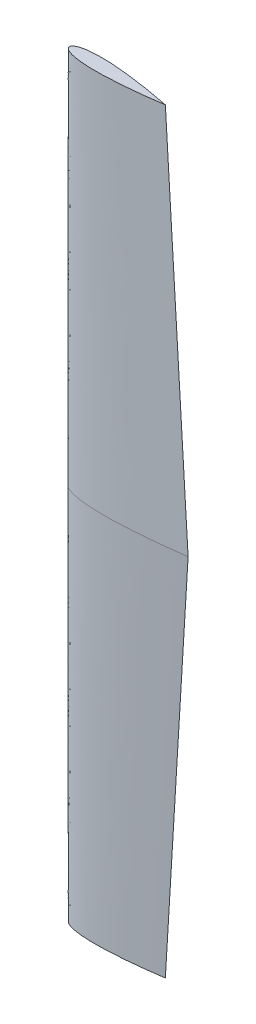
ISO-10303-21;
HEADER;
FILE_DESCRIPTION(('STEP AP214'),'2;1');
FILE_NAME('part.step','',(''),(''),'','','');
FILE_SCHEMA(('AUTOMOTIVE_DESIGN { 1 0 10303 214 1 1 1 1 }'));
ENDSEC;
DATA;
#1=APPLICATION_CONTEXT('core data for automotive mechanical design processes');
#2=APPLICATION_PROTOCOL_DEFINITION('international standard','automotive_design',2000,#1);
#3=PRODUCT_CONTEXT('',#1,'mechanical');
#4=PRODUCT('Part','Part','',(#3));
#5=PRODUCT_RELATED_PRODUCT_CATEGORY('part','',(#4));
#6=PRODUCT_DEFINITION_FORMATION('','',#4);
#7=PRODUCT_DEFINITION_CONTEXT('part definition',#1,'design');
#8=PRODUCT_DEFINITION('design','',#6,#7);
#9=PRODUCT_DEFINITION_SHAPE('','',#8);
#10=(LENGTH_UNIT() NAMED_UNIT(*) SI_UNIT(.MILLI.,.METRE.));
#11=(NAMED_UNIT(*) PLANE_ANGLE_UNIT() SI_UNIT($,.RADIAN.));
#12=(NAMED_UNIT(*) SI_UNIT($,.STERADIAN.) SOLID_ANGLE_UNIT());
#13=UNCERTAINTY_MEASURE_WITH_UNIT(LENGTH_MEASURE(1.E-05),#10,'distance_accuracy_value','');
#14=(GEOMETRIC_REPRESENTATION_CONTEXT(3) GLOBAL_UNCERTAINTY_ASSIGNED_CONTEXT((#13)) GLOBAL_UNIT_ASSIGNED_CONTEXT((#10,
#11,#12)) REPRESENTATION_CONTEXT('',''));
#15=CARTESIAN_POINT('',(0.,0.,0.));
#16=DIRECTION('',(0.,0.,1.));
#17=DIRECTION('',(1.,0.,0.));
#18=AXIS2_PLACEMENT_3D('',#15,#16,#17);
#19=CARTESIAN_POINT('',(203.181891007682,1599.9984,32.8644159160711));
#20=DIRECTION('',(0.,-1.,0.));
#21=DIRECTION('',(0.,0.,-1.));
#22=AXIS2_PLACEMENT_3D('',#19,#20,#21);
#23=PLANE('',#22);
#24=CARTESIAN_POINT('',(0.,1599.9984,0.));
#25=CARTESIAN_POINT('',(-0.0230112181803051,1599.9984,0.453100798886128));
#26=CARTESIAN_POINT('',(-0.016550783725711,1599.9984,1.18793147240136));
#27=CARTESIAN_POINT('',(0.0963908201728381,1599.9984,2.24795142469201));
#28=CARTESIAN_POINT('',(0.440326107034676,1599.9984,3.62639899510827));
#29=CARTESIAN_POINT('',(0.928161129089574,1599.9984,4.91189979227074));
#30=CARTESIAN_POINT('',(1.66382534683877,1599.9984,6.31552749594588));
#31=CARTESIAN_POINT('',(2.72725352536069,1599.9984,7.86486102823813));
#32=CARTESIAN_POINT('',(4.27482361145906,1599.9984,9.63109102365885));
#33=CARTESIAN_POINT('',(6.57878264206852,1599.9984,11.7119920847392));
#34=CARTESIAN_POINT('',(10.1208645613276,1599.9984,14.2353507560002));
#35=CARTESIAN_POINT('',(15.5794981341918,1599.9984,17.2566291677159));
#36=CARTESIAN_POINT('',(24.1079211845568,1599.9984,20.8498243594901));
#37=CARTESIAN_POINT('',(36.983171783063,1599.9984,24.8250206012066));
#38=CARTESIAN_POINT('',(56.3478301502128,1599.9984,28.9752541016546));
#39=CARTESIAN_POINT('',(81.4932538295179,1599.9984,32.2608689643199));
#40=CARTESIAN_POINT('',(111.002048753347,1599.9984,34.2208136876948));
#41=CARTESIAN_POINT('',(139.216482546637,1599.9984,34.7117514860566));
#42=CARTESIAN_POINT('',(163.396776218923,1599.9984,34.4206377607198));
#43=CARTESIAN_POINT('',(183.53797274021,1599.9984,33.7892261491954));
#44=CARTESIAN_POINT('',(199.642904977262,1599.9984,33.0814213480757));
#45=CARTESIAN_POINT('',(215.738994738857,1599.9984,32.1938777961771));
#46=CARTESIAN_POINT('',(231.825464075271,1599.9984,31.1470364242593));
#47=CARTESIAN_POINT('',(247.901707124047,1599.9984,29.9565165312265));
#48=CARTESIAN_POINT('',(263.968140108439,1599.9984,28.6352917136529));
#49=CARTESIAN_POINT('',(278.016388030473,1599.9984,27.3735160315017));
#50=CARTESIAN_POINT('',(290.052356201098,1599.9984,26.2208364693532));
#51=CARTESIAN_POINT('',(300.075823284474,1599.9984,25.2147204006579));
#52=CARTESIAN_POINT('',(308.095199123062,1599.9984,24.3822812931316));
#53=CARTESIAN_POINT('',(318.108673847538,1599.9984,23.3094422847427));
#54=CARTESIAN_POINT('',(330.132111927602,1599.9984,21.9669541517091));
#55=CARTESIAN_POINT('',(344.128132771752,1599.9984,20.3270512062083));
#56=CARTESIAN_POINT('',(360.146997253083,1599.9984,18.339851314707));
#57=CARTESIAN_POINT('',(374.100442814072,1599.9984,16.5118809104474));
#58=CARTESIAN_POINT('',(386.128009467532,1599.9984,14.8604727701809));
#59=CARTESIAN_POINT('',(396.020110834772,1599.9984,13.4528734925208));
#60=CARTESIAN_POINT('',(403.16078388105,1599.9984,12.40603134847));
#61=CARTESIAN_POINT('',(408.833701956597,1599.9984,11.5573585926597));
#62=CARTESIAN_POINT('',(413.267948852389,1599.9984,10.8791730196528));
#63=CARTESIAN_POINT('',(415.094444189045,1599.9984,10.5976981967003));
#64=CARTESIAN_POINT('',(416.00000000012,1599.9984,10.4574222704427));
#65=B_SPLINE_CURVE_WITH_KNOTS('',4,(#24,#25,#26,#27,#28,#29,#30,#31,#32,#33,#34,#35,#36,#37,#38,
#39,#40,#41,#42,#43,#44,#45,#46,#47,#48,#49,#50,#51,#52,#53,#54,#55,#56,#57,#58,#59,#60,#61,#62,
#63,#64),.UNSPECIFIED.,.F.,.F.,(5,1,1,1,1,1,1,1,1,1,1,1,1,1,1,1,1,1,1,1,1,1,1,1,1,1,1,1,1,1,1,1,
1,1,1,1,1,5),(0.,0.00384565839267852,0.00624527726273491,0.00902261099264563,0.0120445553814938,
0.015501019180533,0.0196795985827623,0.0249537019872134,0.0319537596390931,0.041823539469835,
0.0565555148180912,0.0778612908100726,0.110456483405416,0.156156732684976,0.224644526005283,
0.293132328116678,0.361620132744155,0.395864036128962,0.430107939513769,0.464351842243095,
0.498595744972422,0.532839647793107,0.567083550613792,0.601327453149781,0.63557135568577,
0.652693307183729,0.669815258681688,0.686937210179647,0.704059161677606,0.738303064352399,
0.772546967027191,0.806790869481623,0.841034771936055,0.858156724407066,0.875278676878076,
0.892400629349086,0.900961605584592,0.909522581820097),.UNSPECIFIED.);
#66=CARTESIAN_POINT('',(-2.05588158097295E-12,1599.9984,0.));
#67=VERTEX_POINT('',#66);
#68=CARTESIAN_POINT('',(416.000000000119,1599.9984,10.4574222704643));
#69=VERTEX_POINT('',#68);
#70=EDGE_CURVE('E91',#67,#69,#65,.T.);
#71=ORIENTED_EDGE('',*,*,#70,.T.);
#72=CARTESIAN_POINT('',(416.000000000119,1599.9984,10.4574222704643));
#73=CARTESIAN_POINT('',(415.1026360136,1599.9984,10.2718244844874));
#74=CARTESIAN_POINT('',(413.292590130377,1599.9984,9.89893416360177));
#75=CARTESIAN_POINT('',(408.898018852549,1599.9984,8.99880945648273));
#76=CARTESIAN_POINT('',(403.274906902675,1599.9984,7.8661767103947));
#77=CARTESIAN_POINT('',(396.195850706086,1599.9984,6.46187852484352));
#78=CARTESIAN_POINT('',(386.386967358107,1599.9984,4.55903521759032));
#79=CARTESIAN_POINT('',(374.457565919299,1599.9984,2.30539599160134));
#80=CARTESIAN_POINT('',(360.613589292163,1599.9984,-0.221346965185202));
#81=CARTESIAN_POINT('',(344.714802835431,1599.9984,-3.01089386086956));
#82=CARTESIAN_POINT('',(330.818855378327,1599.9984,-5.35194606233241));
#83=CARTESIAN_POINT('',(318.878055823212,1599.9984,-7.29684802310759));
#84=CARTESIAN_POINT('',(308.931132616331,1599.9984,-8.87145219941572));
#85=CARTESIAN_POINT('',(300.963710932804,1599.9984,-10.1057679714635));
#86=CARTESIAN_POINT('',(291.003455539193,1599.9984,-11.6142355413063));
#87=CARTESIAN_POINT('',(279.040604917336,1599.9984,-13.3701982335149));
#88=CARTESIAN_POINT('',(265.073497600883,1599.9984,-15.336224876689));
#89=CARTESIAN_POINT('',(249.093741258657,1599.9984,-17.4630279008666));
#90=CARTESIAN_POINT('',(233.097620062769,1599.9984,-19.4597839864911));
#91=CARTESIAN_POINT('',(217.084066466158,1599.9984,-21.3135568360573));
#92=CARTESIAN_POINT('',(201.052900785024,1599.9984,-23.0087164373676));
#93=CARTESIAN_POINT('',(185.003872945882,1599.9984,-24.5248085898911));
#94=CARTESIAN_POINT('',(164.91984047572,1599.9984,-26.1674033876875));
#95=CARTESIAN_POINT('',(140.784714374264,1599.9984,-27.6730717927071));
#96=CARTESIAN_POINT('',(112.581249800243,1599.9984,-28.6003690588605));
#97=CARTESIAN_POINT('',(83.0112496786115,1599.9984,-28.1255491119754));
#98=CARTESIAN_POINT('',(57.7325022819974,1599.9984,-26.1074987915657));
#99=CARTESIAN_POINT('',(38.1837766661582,1599.9984,-22.9354712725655));
#100=CARTESIAN_POINT('',(25.1250570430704,1599.9984,-19.6122040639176));
#101=CARTESIAN_POINT('',(16.4268681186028,1599.9984,-16.4520520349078));
#102=CARTESIAN_POINT('',(10.8233269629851,1599.9984,-13.7088549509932));
#103=CARTESIAN_POINT('',(7.15893441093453,1599.9984,-11.3666528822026));
#104=CARTESIAN_POINT('',(4.75333192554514,1599.9984,-9.40414094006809));
#105=CARTESIAN_POINT('',(3.11897346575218,1599.9984,-7.71789837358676));
#106=CARTESIAN_POINT('',(1.97904323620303,1599.9984,-6.22395294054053));
#107=CARTESIAN_POINT('',(1.17378387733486,1599.9984,-4.85906102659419));
#108=CARTESIAN_POINT('',(0.621975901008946,1599.9984,-3.5996948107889));
#109=CARTESIAN_POINT('',(0.209215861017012,1599.9984,-2.24026907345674));
#110=CARTESIAN_POINT('',(0.0431569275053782,1599.9984,-1.18726264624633));
#111=CARTESIAN_POINT('',(-0.00021641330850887,1599.9984,-0.453684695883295));
#112=CARTESIAN_POINT('',(-2.05588158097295E-12,1599.9984,0.));
#113=B_SPLINE_CURVE_WITH_KNOTS('',4,(#72,#73,#74,#75,#76,#77,#78,#79,#80,#81,#82,#83,#84,#85,
#86,#87,#88,#89,#90,#91,#92,#93,#94,#95,#96,#97,#98,#99,#100,#101,#102,#103,#104,#105,#106,#107,
#108,#109,#110,#111,#112),.UNSPECIFIED.,.F.,.F.,(5,1,1,1,1,1,1,1,1,1,1,1,1,1,1,1,1,1,1,1,1,1,1,
1,1,1,1,1,1,1,1,1,1,1,1,1,1,5),(0.,0.00856097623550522,0.0171219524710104,0.0342439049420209,
0.0513658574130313,0.0684878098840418,0.102731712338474,0.136975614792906,0.171219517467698,
0.205463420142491,0.22258537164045,0.239707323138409,0.256829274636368,0.273951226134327,
0.308195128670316,0.342439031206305,0.37668293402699,0.410926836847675,0.445170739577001,
0.479414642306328,0.513658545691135,0.547902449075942,0.616390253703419,0.684878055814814,
0.753365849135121,0.799066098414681,0.831661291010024,0.852967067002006,0.867699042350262,
0.877568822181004,0.884568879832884,0.889842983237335,0.894021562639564,0.897478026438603,
0.900499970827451,0.903277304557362,0.905676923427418,0.909522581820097),.UNSPECIFIED.);
#114=EDGE_CURVE('E12',#69,#67,#113,.T.);
#115=ORIENTED_EDGE('',*,*,#114,.T.);
#116=EDGE_LOOP('',(#71,#115));
#117=FACE_BOUND('',#116,.T.);
#118=ADVANCED_FACE('F81',(#117),#23,.F.);
#119=CARTESIAN_POINT('',(0.,0.,0.));
#120=CARTESIAN_POINT('',(0.,1599.9984,0.));
#121=CARTESIAN_POINT('',(-0.0397759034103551,0.,0.565329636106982));
#122=CARTESIAN_POINT('',(-0.0230023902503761,1599.9984,0.452926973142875));
#123=CARTESIAN_POINT('',(-0.0458986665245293,0.,1.13134009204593));
#124=CARTESIAN_POINT('',(-0.0190345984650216,1599.9984,0.905414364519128));
#125=CARTESIAN_POINT('',(-0.000451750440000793,0.,2.05010579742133));
#126=CARTESIAN_POINT('',(0.0315333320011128,1599.9984,1.63904382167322));
#127=CARTESIAN_POINT('',(0.133524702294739,0.,2.96030222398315));
#128=CARTESIAN_POINT('',(0.152333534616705,1599.9984,2.36468848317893));
#129=CARTESIAN_POINT('',(0.272559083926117,0.,3.71016615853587));
#130=CARTESIAN_POINT('',(0.274599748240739,1599.9984,2.96218946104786));
#131=CARTESIAN_POINT('',(0.469495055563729,0.,4.44701707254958));
#132=CARTESIAN_POINT('',(0.442593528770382,1599.9984,3.54856462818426));
#133=CARTESIAN_POINT('',(0.723427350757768,0.,5.26311051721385));
#134=CARTESIAN_POINT('',(0.657053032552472,1599.9984,4.19749149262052));
#135=CARTESIAN_POINT('',(1.04186828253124,0.,6.05582252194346));
#136=CARTESIAN_POINT('',(0.9222466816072,1599.9984,4.8269916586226));
#137=CARTESIAN_POINT('',(1.4323890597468,0.,6.9263287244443));
#138=CARTESIAN_POINT('',(1.24579153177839,1599.9984,5.51791684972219));
#139=CARTESIAN_POINT('',(1.89073585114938,0.,7.76314347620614));
#140=CARTESIAN_POINT('',(1.62251249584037,1599.9984,6.18139874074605));
#141=CARTESIAN_POINT('',(2.46896798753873,0.,8.72752875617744));
#142=CARTESIAN_POINT('',(2.09630251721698,1599.9984,6.94561366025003));
#143=CARTESIAN_POINT('',(3.12175457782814,0.,9.64355994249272));
#144=CARTESIAN_POINT('',(2.62845357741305,1599.9984,7.67074947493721));
#145=CARTESIAN_POINT('',(3.97283568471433,0.,10.745061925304));
#146=CARTESIAN_POINT('',(3.32083004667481,1599.9984,8.54230286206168));
#147=CARTESIAN_POINT('',(4.90820205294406,0.,11.7766102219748));
#148=CARTESIAN_POINT('',(4.07911814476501,1599.9984,9.35768905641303));
#149=CARTESIAN_POINT('',(6.17205215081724,0.,13.0686220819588));
#150=CARTESIAN_POINT('',(5.10228561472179,1599.9984,10.3784378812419));
#151=CARTESIAN_POINT('',(7.53313403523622,0.,14.2588059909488));
#152=CARTESIAN_POINT('',(6.20148098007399,1599.9984,11.3176408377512));
#153=CARTESIAN_POINT('',(9.46208494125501,0.,15.8238691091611));
#154=CARTESIAN_POINT('',(7.75779116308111,1599.9984,12.5519094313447));
#155=CARTESIAN_POINT('',(11.5070075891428,0.,17.2361046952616));
#156=CARTESIAN_POINT('',(9.40477893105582,1599.9984,13.6639515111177));
#157=CARTESIAN_POINT('',(14.5592195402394,0.,19.1868436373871));
#158=CARTESIAN_POINT('',(11.8613867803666,1599.9984,15.1987058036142));
#159=CARTESIAN_POINT('',(17.7528909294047,0.,20.9002339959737));
#160=CARTESIAN_POINT('',(14.4285440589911,1599.9984,16.5436466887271));
#161=CARTESIAN_POINT('',(22.5120620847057,0.,23.24624003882));
#162=CARTESIAN_POINT('',(18.2522214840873,1599.9984,18.3827006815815));
#163=CARTESIAN_POINT('',(27.4278342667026,0.,25.2489576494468));
#164=CARTESIAN_POINT('',(22.1980388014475,1599.9984,19.947089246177));
#165=CARTESIAN_POINT('',(34.8657638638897,0.,28.0143455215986));
#166=CARTESIAN_POINT('',(28.1662107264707,1599.9984,22.1028092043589));
#167=CARTESIAN_POINT('',(42.473226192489,0.,30.2827289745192));
#168=CARTESIAN_POINT('',(34.2659875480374,1599.9984,23.8606687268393));
#169=CARTESIAN_POINT('',(53.6097592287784,0.,33.2553518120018));
#170=CARTESIAN_POINT('',(43.1928407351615,1599.9984,26.1558767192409));
#171=CARTESIAN_POINT('',(64.9037373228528,0.,35.5713651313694));
#172=CARTESIAN_POINT('',(52.2407322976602,1599.9984,27.9251248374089));
#173=CARTESIAN_POINT('',(81.4502733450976,0.,38.5307044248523));
#174=CARTESIAN_POINT('',(65.49340398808,1599.9984,30.1702559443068));
#175=CARTESIAN_POINT('',(98.1360332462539,0.,40.5973899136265));
#176=CARTESIAN_POINT('',(78.8509288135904,1599.9984,31.699986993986));
#177=CARTESIAN_POINT('',(118.199546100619,0.,42.5989633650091));
#178=CARTESIAN_POINT('',(94.9090347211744,1599.9984,33.1519315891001));
#179=CARTESIAN_POINT('',(138.32643301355,0.,43.7951882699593));
#180=CARTESIAN_POINT('',(111.011900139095,1599.9984,33.958031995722));
#181=CARTESIAN_POINT('',(153.433210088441,0.,44.4465029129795));
#182=CARTESIAN_POINT('',(123.09643445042,1599.9984,34.3655206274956));
#183=CARTESIAN_POINT('',(173.587732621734,0.,44.8921528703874));
#184=CARTESIAN_POINT('',(139.215798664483,1599.9984,34.569368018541));
#185=CARTESIAN_POINT('',(183.667234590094,0.,44.9855451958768));
#186=CARTESIAN_POINT('',(147.276372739,1599.9984,34.5672522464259));
#187=CARTESIAN_POINT('',(198.786551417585,0.,44.9584911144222));
#188=CARTESIAN_POINT('',(159.365839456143,1599.9984,34.4302747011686));
#189=CARTESIAN_POINT('',(213.904836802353,0.,44.7754016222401));
#190=CARTESIAN_POINT('',(171.453263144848,1599.9984,34.1680728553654));
#191=CARTESIAN_POINT('',(223.982273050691,0.,44.5567223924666));
#192=CARTESIAN_POINT('',(179.509748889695,1599.9984,33.9155079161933));
#193=CARTESIAN_POINT('',(239.09472683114,0.,44.1022377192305));
#194=CARTESIAN_POINT('',(191.59044593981,1599.9984,33.4353234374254));
#195=CARTESIAN_POINT('',(254.203116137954,0.,43.5286420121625));
#196=CARTESIAN_POINT('',(203.666934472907,1599.9984,32.8595350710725));
#197=CARTESIAN_POINT('',(264.2724010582,0.,43.0717412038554));
#198=CARTESIAN_POINT('',(211.714985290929,1599.9984,32.4157629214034));
#199=CARTESIAN_POINT('',(279.371280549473,0.,42.2870089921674));
#200=CARTESIAN_POINT('',(223.782235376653,1599.9984,31.6704567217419));
#201=CARTESIAN_POINT('',(289.433756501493,0.,41.7009437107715));
#202=CARTESIAN_POINT('',(231.823771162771,1599.9984,31.1230892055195));
#203=CARTESIAN_POINT('',(299.494445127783,0.,41.0850963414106));
#204=CARTESIAN_POINT('',(239.863597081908,1599.9984,30.5517756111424));
#205=CARTESIAN_POINT('',(309.55144334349,0.,40.4123032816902));
#206=CARTESIAN_POINT('',(247.900082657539,1599.9984,29.9347315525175));
#207=CARTESIAN_POINT('',(319.60653396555,0.,39.7123467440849));
#208=CARTESIAN_POINT('',(255.934934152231,1599.9984,29.2959032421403));
#209=CARTESIAN_POINT('',(329.657956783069,0.,38.9601305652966));
#210=CARTESIAN_POINT('',(263.966267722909,1599.9984,28.615156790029));
#211=CARTESIAN_POINT('',(337.195211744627,0.,38.3771456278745));
#212=CARTESIAN_POINT('',(269.988361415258,1599.9984,28.0894959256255));
#213=CARTESIAN_POINT('',(347.241611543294,0.,37.5633530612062));
#214=CARTESIAN_POINT('',(278.015319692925,1599.9984,27.3592836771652));
#215=CARTESIAN_POINT('',(352.263629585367,0.,37.1444899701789));
#216=CARTESIAN_POINT('',(282.028031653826,1599.9984,26.9845444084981));
#217=CARTESIAN_POINT('',(359.796141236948,0.,36.4985602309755));
#218=CARTESIAN_POINT('',(288.04571958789,1599.9984,26.4083939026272));
#219=CARTESIAN_POINT('',(364.816479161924,0.,36.0564421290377));
#220=CARTESIAN_POINT('',(292.056407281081,1599.9984,26.0150574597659));
#221=CARTESIAN_POINT('',(369.83564494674,0.,35.6087047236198));
#222=CARTESIAN_POINT('',(296.066444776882,1599.9984,25.6171659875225));
#223=CARTESIAN_POINT('',(374.854248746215,0.,35.1495709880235));
#224=CARTESIAN_POINT('',(300.075931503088,1599.9984,25.2101285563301));
#225=CARTESIAN_POINT('',(379.873464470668,0.,34.684660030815));
#226=CARTESIAN_POINT('',(304.085519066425,1599.9984,24.7985000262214));
#227=CARTESIAN_POINT('',(384.891133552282,0.,34.2086557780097));
#228=CARTESIAN_POINT('',(308.093773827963,1599.9984,24.3779751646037));
#229=CARTESIAN_POINT('',(389.906645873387,0.,33.7273352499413));
#230=CARTESIAN_POINT('',(312.100596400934,1599.9984,23.9531448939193));
#231=CARTESIAN_POINT('',(394.921179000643,0.,33.2349381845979));
#232=CARTESIAN_POINT('',(316.106591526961,1599.9984,23.5194192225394));
#233=CARTESIAN_POINT('',(402.444747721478,0.,32.4877018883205));
#234=CARTESIAN_POINT('',(322.116493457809,1599.9984,22.8619454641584));
#235=CARTESIAN_POINT('',(409.96799261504,0.,31.7153752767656));
#236=CARTESIAN_POINT('',(328.125526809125,1599.9984,22.1843871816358));
#237=CARTESIAN_POINT('',(419.988696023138,0.,30.6647816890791));
#238=CARTESIAN_POINT('',(336.130412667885,1599.9984,21.2641378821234));
#239=CARTESIAN_POINT('',(430.006002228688,0.,29.5697015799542));
#240=CARTESIAN_POINT('',(344.132039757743,1599.9984,20.3082130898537));
#241=CARTESIAN_POINT('',(440.030205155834,0.,28.4509592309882));
#242=CARTESIAN_POINT('',(352.137569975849,1599.9984,19.3334506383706));
#243=CARTESIAN_POINT('',(450.043733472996,0.,27.2876699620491));
#244=CARTESIAN_POINT('',(360.134989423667,1599.9984,18.3228659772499));
#245=CARTESIAN_POINT('',(460.039695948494,0.,26.1034953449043));
#246=CARTESIAN_POINT('',(368.120398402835,1599.9984,17.2952963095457));
#247=CARTESIAN_POINT('',(472.54851095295,0.,24.5612900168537));
#248=CARTESIAN_POINT('',(378.10963318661,1599.9984,15.9614113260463));
#249=CARTESIAN_POINT('',(482.598556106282,0.,23.2844680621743));
#250=CARTESIAN_POINT('',(386.128011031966,1599.9984,14.8604725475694));
#251=CARTESIAN_POINT('',(494.963130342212,0.,21.6528156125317));
#252=CARTESIAN_POINT('',(396.020110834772,1599.9984,13.4528734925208));
#253=CARTESIAN_POINT('',(503.948715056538,0.,20.428098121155));
#254=CARTESIAN_POINT('',(403.16078388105,1599.9984,12.40603134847));
#255=CARTESIAN_POINT('',(510.982974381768,0.,19.4490726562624));
#256=CARTESIAN_POINT('',(408.833701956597,1599.9984,11.5573585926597));
#257=CARTESIAN_POINT('',(516.60071764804,0.,18.6481591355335));
#258=CARTESIAN_POINT('',(413.267948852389,1599.9984,10.8791730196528));
#259=CARTESIAN_POINT('',(518.866012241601,0.,18.3226532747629));
#260=CARTESIAN_POINT('',(415.094444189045,1599.9984,10.5976981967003));
#261=CARTESIAN_POINT('',(520.000000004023,0.,18.1588001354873));
#262=CARTESIAN_POINT('',(416.00000000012,1599.9984,10.4574222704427));
#263=B_SPLINE_SURFACE_WITH_KNOTS('',4,1,((#119,#120),(#121,#122),(#123,#124),(#125,#126),(#127,
#128),(#129,#130),(#131,#132),(#133,#134),(#135,#136),(#137,#138),(#139,#140),(#141,#142),(#143,
#144),(#145,#146),(#147,#148),(#149,#150),(#151,#152),(#153,#154),(#155,#156),(#157,#158),(#159,
#160),(#161,#162),(#163,#164),(#165,#166),(#167,#168),(#169,#170),(#171,#172),(#173,#174),(#175,
#176),(#177,#178),(#179,#180),(#181,#182),(#183,#184),(#185,#186),(#187,#188),(#189,#190),(#191,
#192),(#193,#194),(#195,#196),(#197,#198),(#199,#200),(#201,#202),(#203,#204),(#205,#206),(#207,
#208),(#209,#210),(#211,#212),(#213,#214),(#215,#216),(#217,#218),(#219,#220),(#221,#222),(#223,
#224),(#225,#226),(#227,#228),(#229,#230),(#231,#232),(#233,#234),(#235,#236),(#237,#238),(#239,
#240),(#241,#242),(#243,#244),(#245,#246),(#247,#248),(#249,#250),(#251,#252),(#253,#254),(#255,
#256),(#257,#258),(#259,#260),(#261,#262)),.UNSPECIFIED.,.F.,.F.,.F.,(5,1,1,1,1,1,1,1,1,1,1,1,1,
1,1,1,1,1,1,1,1,1,1,1,1,1,1,1,1,1,1,1,1,1,1,1,1,1,1,1,1,1,1,1,1,1,1,1,1,1,1,1,1,1,1,1,1,1,1,1,1,
1,1,1,1,1,1,1,5),(2,2),(0.,0.0042265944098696,0.00422821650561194,0.00686167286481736,
0.00686654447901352,0.00992016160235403,0.00992187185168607,0.0132421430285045,
0.013242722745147,0.0170430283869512,0.0170435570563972,0.0216372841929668,0.0216380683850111,
0.0274360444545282,0.0274364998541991,0.0351322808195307,0.0351324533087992,0.0459840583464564,
0.0459841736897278,0.0621815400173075,0.062181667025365,0.0856067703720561,0.085606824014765,
0.121444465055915,0.121444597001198,0.171690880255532,0.171690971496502,0.246991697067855,
0.246991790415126,0.322292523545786,0.322292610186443,0.35994302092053,0.397593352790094,
0.397593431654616,0.435243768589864,0.472894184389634,0.472894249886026,0.510544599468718,
0.548195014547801,0.548195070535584,0.585845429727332,0.585845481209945,0.623495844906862,
0.623495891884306,0.661146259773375,0.66114630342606,0.679971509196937,0.698796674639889,
0.698796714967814,0.717621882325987,0.717621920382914,0.736447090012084,0.736447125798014,
0.755272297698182,0.755272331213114,0.774097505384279,0.774097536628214,0.811747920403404,
0.811747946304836,0.849398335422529,0.849398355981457,0.887048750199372,0.887048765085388,
0.924699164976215,0.943524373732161,0.962349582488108,0.981174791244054,0.990587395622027,1.),
(0.,1.),.UNSPECIFIED.);
#264=CARTESIAN_POINT('',(0.,0.,0.));
#265=CARTESIAN_POINT('',(-0.0397759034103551,0.,0.565329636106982));
#266=CARTESIAN_POINT('',(-0.049712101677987,0.,1.48386788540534));
#267=CARTESIAN_POINT('',(0.0658815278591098,0.,2.81259360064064));
#268=CARTESIAN_POINT('',(0.464431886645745,0.,4.54359339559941));
#269=CARTESIAN_POINT('',(1.04691677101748,0.,6.16195690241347));
#270=CARTESIAN_POINT('',(1.93960988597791,0.,7.93213818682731));
#271=CARTESIAN_POINT('',(3.24159878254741,0.,9.88848330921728));
#272=CARTESIAN_POINT('',(5.14837945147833,0.,12.1221182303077));
#273=CARTESIAN_POINT('',(7.99906553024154,0.,14.7579073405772));
#274=CARTESIAN_POINT('',(12.3947129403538,0.,17.9605965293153));
#275=CARTESIAN_POINT('',(19.1831913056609,0.,21.8064444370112));
#276=CARTESIAN_POINT('',(29.8054083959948,0.,26.400742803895));
#277=CARTESIAN_POINT('',(45.8599635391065,0.,31.5200843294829));
#278=CARTESIAN_POINT('',(70.027618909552,0.,36.9314990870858));
#279=CARTESIAN_POINT('',(101.433932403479,0.,41.3284769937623));
#280=CARTESIAN_POINT('',(133.283136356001,0.,43.7419877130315));
#281=CARTESIAN_POINT('',(163.508264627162,0.,44.7987611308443));
#282=CARTESIAN_POINT('',(193.746735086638,0.,45.0789373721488));
#283=CARTESIAN_POINT('',(223.985570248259,0.,44.6905440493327));
#284=CARTESIAN_POINT('',(254.208012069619,0.,43.6330402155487));
#285=CARTESIAN_POINT('',(284.406097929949,0.,42.0535401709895));
#286=CARTESIAN_POINT('',(309.553365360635,0.,40.4394657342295));
#287=CARTESIAN_POINT('',(327.146431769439,0.,39.1670059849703));
#288=CARTESIAN_POINT('',(342.219610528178,0.,37.9822147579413));
#289=CARTESIAN_POINT('',(354.774641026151,0.,36.9350582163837));
#290=CARTESIAN_POINT('',(364.81766226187,0.,36.0620604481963));
#291=CARTESIAN_POINT('',(374.85364726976,0.,35.1553472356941));
#292=CARTESIAN_POINT('',(384.893300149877,0.,34.2139711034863));
#293=CARTESIAN_POINT('',(397.426685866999,0.,32.99737940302));
#294=CARTESIAN_POINT('',(412.480893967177,0.,31.468344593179));
#295=CARTESIAN_POINT('',(429.999113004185,0.,29.5933629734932));
#296=CARTESIAN_POINT('',(450.061306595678,0.,27.3085544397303));
#297=CARTESIAN_POINT('',(467.523491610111,0.,25.1997005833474));
#298=CARTESIAN_POINT('',(482.598556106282,0.,23.2844680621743));
#299=CARTESIAN_POINT('',(494.963130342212,0.,21.6528156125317));
#300=CARTESIAN_POINT('',(503.948715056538,0.,20.428098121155));
#301=CARTESIAN_POINT('',(510.982974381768,0.,19.4490726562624));
#302=CARTESIAN_POINT('',(516.60071764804,0.,18.6481591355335));
#303=CARTESIAN_POINT('',(518.866012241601,0.,18.3226532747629));
#304=CARTESIAN_POINT('',(520.000000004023,0.,18.1588001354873));
#305=B_SPLINE_CURVE_WITH_KNOTS('',4,(#264,#265,#266,#267,#268,#269,#270,#271,#272,#273,#274,
#275,#276,#277,#278,#279,#280,#281,#282,#283,#284,#285,#286,#287,#288,#289,#290,#291,#292,#293,
#294,#295,#296,#297,#298,#299,#300,#301,#302,#303,#304),.UNSPECIFIED.,.F.,.F.,(5,1,1,1,1,1,1,1,
1,1,1,1,1,1,1,1,1,1,1,1,1,1,1,1,1,1,1,1,1,1,1,1,1,1,1,1,1,5),(0.,0.00384360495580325,
0.00623990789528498,0.00902280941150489,0.0120422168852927,0.0154991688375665,
0.0196773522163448,0.0249503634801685,0.0319487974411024,0.0418173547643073,0.0565471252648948,
0.0778496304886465,0.110439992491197,0.156133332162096,0.224610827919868,0.293088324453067,
0.327327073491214,0.361565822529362,0.430043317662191,0.498520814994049,0.532759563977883,
0.566998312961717,0.601237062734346,0.61835643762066,0.635475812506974,0.65259518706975,
0.669714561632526,0.686833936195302,0.703953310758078,0.738192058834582,0.772430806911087,
0.806669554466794,0.840908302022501,0.858027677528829,0.875147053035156,0.892266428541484,
0.900826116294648,0.909385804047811),.UNSPECIFIED.);
#306=CARTESIAN_POINT('',(0.,0.,0.));
#307=VERTEX_POINT('',#306);
#308=CARTESIAN_POINT('',(520.000000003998,0.,18.1588001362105));
#309=VERTEX_POINT('',#308);
#310=EDGE_CURVE('E85',#307,#309,#305,.T.);
#311=DIRECTION('',(-0.0648624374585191,0.997882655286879,-0.00480317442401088));
#312=VECTOR('',#311,1.);
#313=CARTESIAN_POINT('',(468.000000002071,799.9992,14.308111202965));
#314=LINE('',#313,#312);
#315=EDGE_CURVE('E99',#309,#69,#314,.T.);
#316=DIRECTION('',(0.,-1.,0.));
#317=VECTOR('',#316,1.);
#318=CARTESIAN_POINT('',(0.,799.9992,0.));
#319=LINE('',#318,#317);
#320=EDGE_CURVE('E139',#67,#307,#319,.T.);
#321=ORIENTED_EDGE('',*,*,#310,.T.);
#322=ORIENTED_EDGE('',*,*,#315,.T.);
#323=ORIENTED_EDGE('',*,*,#70,.F.);
#324=ORIENTED_EDGE('',*,*,#320,.T.);
#325=EDGE_LOOP('',(#321,#322,#323,#324));
#326=FACE_BOUND('',#325,.T.);
#327=ADVANCED_FACE('F142',(#326),#263,.T.);
#328=CARTESIAN_POINT('',(520.000000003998,0.,18.1588001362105));
#329=CARTESIAN_POINT('',(416.000000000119,1599.9984,10.4574222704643));
#330=CARTESIAN_POINT('',(518.880204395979,0.,17.9162431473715));
#331=CARTESIAN_POINT('',(415.1026360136,1599.9984,10.2718244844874));
#332=CARTESIAN_POINT('',(516.643134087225,0.,17.4335112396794));
#333=CARTESIAN_POINT('',(413.292590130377,1599.9984,9.89893416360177));
#334=CARTESIAN_POINT('',(511.094944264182,0.,16.2426747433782));
#335=CARTESIAN_POINT('',(408.898018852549,1599.9984,8.99880945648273));
#336=CARTESIAN_POINT('',(504.146113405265,0.,14.7753490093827));
#337=CARTESIAN_POINT('',(403.274906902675,1599.9984,7.8661767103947));
#338=CARTESIAN_POINT('',(495.267849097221,0.,12.9268121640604));
#339=CARTESIAN_POINT('',(396.195850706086,1599.9984,6.46187852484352));
#340=CARTESIAN_POINT('',(483.04721266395,0.,10.4366252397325));
#341=CARTESIAN_POINT('',(386.38696890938,1599.9984,4.55903551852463));
#342=CARTESIAN_POINT('',(473.110715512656,0.,8.46185784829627));
#343=CARTESIAN_POINT('',(378.4340343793,1599.9984,3.0566093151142));
#344=CARTESIAN_POINT('',(460.739950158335,0.,6.05083842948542));
#345=CARTESIAN_POINT('',(368.524436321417,1599.9984,1.22250675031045));
#346=CARTESIAN_POINT('',(450.850941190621,0.,4.17226530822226));
#347=CARTESIAN_POINT('',(360.600742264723,1599.9984,-0.204986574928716));
#348=CARTESIAN_POINT('',(440.942952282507,0.,2.31330132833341));
#349=CARTESIAN_POINT('',(352.664200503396,1599.9984,-1.61611962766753));
#350=CARTESIAN_POINT('',(431.021207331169,0.,0.498031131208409));
#351=CARTESIAN_POINT('',(344.717758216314,1599.9984,-2.9918832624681));
#352=CARTESIAN_POINT('',(421.104691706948,0.,-1.29315337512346));
#353=CARTESIAN_POINT('',(336.774267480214,1599.9984,-4.34863694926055));
#354=CARTESIAN_POINT('',(411.181683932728,0.,-3.04019670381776));
#355=CARTESIAN_POINT('',(328.825729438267,1599.9984,-5.66992396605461));
#356=CARTESIAN_POINT('',(403.73064006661,0.,-4.33543700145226));
#357=CARTESIAN_POINT('',(322.858329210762,1599.9984,-6.64854624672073));
#358=CARTESIAN_POINT('',(396.277522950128,0.,-5.60567069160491));
#359=CARTESIAN_POINT('',(316.889052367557,1599.9984,-7.60715301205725));
#360=CARTESIAN_POINT('',(391.309552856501,0.,-6.44666445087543));
#361=CARTESIAN_POINT('',(312.909909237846,1599.9984,-8.24160936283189));
#362=CARTESIAN_POINT('',(386.339833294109,0.,-7.27667695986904));
#363=CARTESIAN_POINT('',(308.929492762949,1599.9984,-8.86722312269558));
#364=CARTESIAN_POINT('',(381.367591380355,0.,-8.10153659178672));
#365=CARTESIAN_POINT('',(304.947429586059,1599.9984,-9.48860887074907));
#366=CARTESIAN_POINT('',(376.393032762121,0.,-8.91543783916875));
#367=CARTESIAN_POINT('',(300.963588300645,1599.9984,-10.1011764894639));
#368=CARTESIAN_POINT('',(371.418681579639,0.,-9.72353325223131));
#369=CARTESIAN_POINT('',(296.979617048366,1599.9984,-10.7091537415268));
#370=CARTESIAN_POINT('',(366.442974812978,0.,-10.5202992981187));
#371=CARTESIAN_POINT('',(292.994636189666,1599.9984,-11.3080242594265));
#372=CARTESIAN_POINT('',(361.465706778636,0.,-11.3115414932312));
#373=CARTESIAN_POINT('',(289.008777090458,1599.9984,-11.9023781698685));
#374=CARTESIAN_POINT('',(353.996601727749,0.,-12.481339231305));
#375=CARTESIAN_POINT('',(283.027638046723,1599.9984,-12.7801555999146));
#376=CARTESIAN_POINT('',(349.016035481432,0.,-13.249500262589));
#377=CARTESIAN_POINT('',(279.038822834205,1599.9984,-13.3560375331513));
#378=CARTESIAN_POINT('',(339.050875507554,0.,-14.7621118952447));
#379=CARTESIAN_POINT('',(271.058691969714,1599.9984,-14.4886365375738));
#380=CARTESIAN_POINT('',(331.572647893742,0.,-15.8694490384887));
#381=CARTESIAN_POINT('',(265.070615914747,1599.9984,-15.3162094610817));
#382=CARTESIAN_POINT('',(321.59818178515,0.,-17.3209846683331));
#383=CARTESIAN_POINT('',(257.08362990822,1599.9984,-16.3996249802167));
#384=CARTESIAN_POINT('',(311.616411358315,0.,-18.720643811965));
#385=CARTESIAN_POINT('',(249.09102427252,1599.9984,-17.4413520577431));
#386=CARTESIAN_POINT('',(301.630843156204,0.,-20.093338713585));
#387=CARTESIAN_POINT('',(241.095692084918,1599.9984,-18.4614045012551));
#388=CARTESIAN_POINT('',(291.637621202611,0.,-21.4094840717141));
#389=CARTESIAN_POINT('',(233.094726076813,1599.9984,-19.435952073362));
#390=CARTESIAN_POINT('',(281.640538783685,0.,-22.6960445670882));
#391=CARTESIAN_POINT('',(225.090849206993,1599.9984,-20.3866697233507));
#392=CARTESIAN_POINT('',(266.633179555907,0.,-24.5321098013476));
#393=CARTESIAN_POINT('',(213.076287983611,1599.9984,-21.7373453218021));
#394=CARTESIAN_POINT('',(256.620294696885,0.,-25.6902954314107));
#395=CARTESIAN_POINT('',(205.060699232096,1599.9984,-22.5849257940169));
#396=CARTESIAN_POINT('',(241.588720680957,0.,-27.3164018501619));
#397=CARTESIAN_POINT('',(193.028393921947,1599.9984,-23.7667618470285));
#398=CARTESIAN_POINT('',(226.544783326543,0.,-28.8239709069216));
#399=CARTESIAN_POINT('',(180.987081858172,1599.9984,-24.853326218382));
#400=CARTESIAN_POINT('',(216.507149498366,0.,-29.7450838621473));
#401=CARTESIAN_POINT('',(172.953461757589,1599.9984,-25.510364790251));
#402=CARTESIAN_POINT('',(201.438463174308,0.,-30.9823256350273));
#403=CARTESIAN_POINT('',(160.894479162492,1599.9984,-26.379559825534));
#404=CARTESIAN_POINT('',(186.357863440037,0.,-32.0639840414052));
#405=CARTESIAN_POINT('',(148.82716430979,1599.9984,-27.1237913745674));
#406=CARTESIAN_POINT('',(176.296399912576,0.,-32.6739297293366));
#407=CARTESIAN_POINT('',(140.776877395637,1599.9984,-27.5309025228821));
#408=CARTESIAN_POINT('',(156.159885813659,0.,-33.6352737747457));
#409=CARTESIAN_POINT('',(124.667630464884,1599.9984,-28.1372190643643));
#410=CARTESIAN_POINT('',(141.044474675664,0.,-34.0393411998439));
#411=CARTESIAN_POINT('',(112.577885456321,1599.9984,-28.3374242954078));
#412=CARTESIAN_POINT('',(120.883171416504,0.,-34.250010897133));
#413=CARTESIAN_POINT('',(96.4548566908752,1599.9984,-28.3414195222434));
#414=CARTESIAN_POINT('',(100.728909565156,0.,-33.6528730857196));
#415=CARTESIAN_POINT('',(80.3440809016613,1599.9984,-27.6981373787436));
#416=CARTESIAN_POINT('',(83.9396306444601,0.,-32.7551617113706));
#417=CARTESIAN_POINT('',(66.9265669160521,1599.9984,-26.8414781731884));
#418=CARTESIAN_POINT('',(67.2269680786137,0.,-30.9572592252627));
#419=CARTESIAN_POINT('',(53.5778288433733,1599.9984,-25.2650542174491));
#420=CARTESIAN_POINT('',(55.7989446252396,0.,-29.4347156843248));
#421=CARTESIAN_POINT('',(44.4524704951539,1599.9984,-23.9526458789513));
#422=CARTESIAN_POINT('',(44.4821799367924,0.,-27.2461792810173));
#423=CARTESIAN_POINT('',(35.4215711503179,1599.9984,-22.1088604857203));
#424=CARTESIAN_POINT('',(36.7350145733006,0.,-25.5139912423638));
#425=CARTESIAN_POINT('',(29.2411761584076,1599.9984,-20.6597003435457));
#426=CARTESIAN_POINT('',(29.1222996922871,0.,-23.2741834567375));
#427=CARTESIAN_POINT('',(23.1722296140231,1599.9984,-18.8065698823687));
#428=CARTESIAN_POINT('',(24.0787995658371,0.,-21.6192512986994));
#429=CARTESIAN_POINT('',(19.1527943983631,1599.9984,-17.442412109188));
#430=CARTESIAN_POINT('',(19.1675724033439,0.,-19.6109430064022));
#431=CARTESIAN_POINT('',(15.2415444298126,1599.9984,-15.7977989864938));
#432=CARTESIAN_POINT('',(15.8621605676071,0.,-18.1245056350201));
#433=CARTESIAN_POINT('',(12.6100539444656,1599.9984,-14.5835418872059));
#434=CARTESIAN_POINT('',(12.6813069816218,0.,-16.391430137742));
#435=CARTESIAN_POINT('',(10.0794362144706,1599.9984,-13.1741566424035));
#436=CARTESIAN_POINT('',(10.5428530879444,0.,-15.1252812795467));
#437=CARTESIAN_POINT('',(8.37865486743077,1599.9984,-12.1462708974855));
#438=CARTESIAN_POINT('',(8.50942772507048,0.,-13.6985873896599));
#439=CARTESIAN_POINT('',(6.76229538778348,1599.9984,-10.9917569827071));
#440=CARTESIAN_POINT('',(7.06863833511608,0.,-12.606246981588));
#441=CARTESIAN_POINT('',(5.61729874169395,1599.9984,-10.108968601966));
#442=CARTESIAN_POINT('',(5.71774072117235,0.,-11.4055441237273));
#443=CARTESIAN_POINT('',(4.5441367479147,1599.9984,-9.140917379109));
#444=CARTESIAN_POINT('',(4.71269568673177,0.,-10.4417564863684));
#445=CARTESIAN_POINT('',(3.74583787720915,1599.9984,-8.36466072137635));
#446=CARTESIAN_POINT('',(3.78685087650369,0.,-9.40230612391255));
#447=CARTESIAN_POINT('',(3.0105453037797,1599.9984,-7.52899612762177));
#448=CARTESIAN_POINT('',(3.07175533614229,0.,-8.53404243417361));
#449=CARTESIAN_POINT('',(2.44263241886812,1599.9984,-6.83151375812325));
#450=CARTESIAN_POINT('',(2.42765962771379,0.,-7.61234178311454));
#451=CARTESIAN_POINT('',(1.93104335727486,1599.9984,-6.09206933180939));
#452=CARTESIAN_POINT('',(1.91205609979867,0.,-6.80953812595));
#453=CARTESIAN_POINT('',(1.52146201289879,1599.9984,-5.44835353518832));
#454=CARTESIAN_POINT('',(1.46176316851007,0.,-5.96839378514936));
#455=CARTESIAN_POINT('',(1.16361074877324,1599.9984,-4.77455730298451));
#456=CARTESIAN_POINT('',(1.08880114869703,0.,-5.19982610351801));
#457=CARTESIAN_POINT('',(0.867123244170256,1599.9984,-4.15917669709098));
#458=CARTESIAN_POINT('',(0.778559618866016,0.,-4.40343404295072));
#459=CARTESIAN_POINT('',(0.620329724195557,1599.9984,-3.52184482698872));
#460=CARTESIAN_POINT('',(0.530703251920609,0.,-3.68211561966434));
#461=CARTESIAN_POINT('',(0.423086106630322,1599.9984,-2.94465101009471));
#462=CARTESIAN_POINT('',(0.339699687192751,0.,-2.94377686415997));
#463=CARTESIAN_POINT('',(0.270953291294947,1599.9984,-2.35404788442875));
#464=CARTESIAN_POINT('',(0.142557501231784,0.,-2.04514335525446));
#465=CARTESIAN_POINT('',(0.113846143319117,1599.9984,-1.63538926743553));
#466=CARTESIAN_POINT('',(0.0331314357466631,0.,-1.13178593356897));
#467=CARTESIAN_POINT('',(0.0264813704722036,1599.9984,-0.905227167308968));
#468=CARTESIAN_POINT('',(-0.00024360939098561,0.,-0.566727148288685));
#469=CARTESIAN_POINT('',(-0.00021633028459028,1599.9984,-0.453510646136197));
#470=CARTESIAN_POINT('',(0.,0.,0.));
#471=CARTESIAN_POINT('',(-2.05588158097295E-12,1599.9984,0.));
#472=B_SPLINE_SURFACE_WITH_KNOTS('',4,1,((#328,#329),(#330,#331),(#332,#333),(#334,#335),(#336,
#337),(#338,#339),(#340,#341),(#342,#343),(#344,#345),(#346,#347),(#348,#349),(#350,#351),(#352,
#353),(#354,#355),(#356,#357),(#358,#359),(#360,#361),(#362,#363),(#364,#365),(#366,#367),(#368,
#369),(#370,#371),(#372,#373),(#374,#375),(#376,#377),(#378,#379),(#380,#381),(#382,#383),(#384,
#385),(#386,#387),(#388,#389),(#390,#391),(#392,#393),(#394,#395),(#396,#397),(#398,#399),(#400,
#401),(#402,#403),(#404,#405),(#406,#407),(#408,#409),(#410,#411),(#412,#413),(#414,#415),(#416,
#417),(#418,#419),(#420,#421),(#422,#423),(#424,#425),(#426,#427),(#428,#429),(#430,#431),(#432,
#433),(#434,#435),(#436,#437),(#438,#439),(#440,#441),(#442,#443),(#444,#445),(#446,#447),(#448,
#449),(#450,#451),(#452,#453),(#454,#455),(#456,#457),(#458,#459),(#460,#461),(#462,#463),(#464,
#465),(#466,#467),(#468,#469),(#470,#471)),.UNSPECIFIED.,.F.,.F.,.F.,(5,1,1,1,1,1,1,1,1,1,1,1,1,
1,1,1,1,1,1,1,1,1,1,1,1,1,1,1,1,1,1,1,1,1,1,1,1,1,1,1,1,1,1,1,1,1,1,1,1,1,1,1,1,1,1,1,1,1,1,1,1,
1,1,1,1,1,1,1,5),(2,2),(0.,0.00941260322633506,0.0188252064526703,0.0376504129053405,
0.0564756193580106,0.0753008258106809,0.112951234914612,0.112951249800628,0.150601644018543,
0.150601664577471,0.188252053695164,0.188252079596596,0.225902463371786,0.225902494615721,
0.244727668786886,0.244727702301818,0.263552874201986,0.263552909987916,0.282378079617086,
0.282378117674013,0.301203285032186,0.301203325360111,0.320028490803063,0.33885369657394,
0.338853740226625,0.376504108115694,0.376504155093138,0.414154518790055,0.414154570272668,
0.451804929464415,0.451804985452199,0.489455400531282,0.527105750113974,0.527105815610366,
0.564756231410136,0.602406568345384,0.602406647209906,0.64005697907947,0.677707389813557,
0.677707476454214,0.753008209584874,0.753008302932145,0.828309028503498,0.828309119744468,
0.878555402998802,0.878555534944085,0.914393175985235,0.914393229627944,0.937818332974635,
0.937818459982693,0.954015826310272,0.954015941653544,0.964867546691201,0.964867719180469,
0.972563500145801,0.972563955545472,0.978361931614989,0.978362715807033,0.982956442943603,
0.982956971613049,0.986757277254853,0.986757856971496,0.990078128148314,0.990079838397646,
0.993133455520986,0.993138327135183,0.995771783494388,0.99577340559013,1.),(0.,1.),.UNSPECIFIED.);
#473=CARTESIAN_POINT('',(520.000000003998,0.,18.1588001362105));
#474=CARTESIAN_POINT('',(518.880204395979,0.,17.9162431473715));
#475=CARTESIAN_POINT('',(516.643134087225,0.,17.4335112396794));
#476=CARTESIAN_POINT('',(511.094944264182,0.,16.2426747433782));
#477=CARTESIAN_POINT('',(504.146113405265,0.,14.7753490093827));
#478=CARTESIAN_POINT('',(495.267849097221,0.,12.9268121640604));
#479=CARTESIAN_POINT('',(483.04721266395,0.,10.4366252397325));
#480=CARTESIAN_POINT('',(468.142470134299,0.,7.47447478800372));
#481=CARTESIAN_POINT('',(450.869928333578,0.,4.15265754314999));
#482=CARTESIAN_POINT('',(431.015985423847,0.,0.473946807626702));
#483=CARTESIAN_POINT('',(413.671231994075,0.,-2.61847663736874));
#484=CARTESIAN_POINT('',(398.760355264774,0.,-5.19391526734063));
#485=CARTESIAN_POINT('',(386.342365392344,0.,-7.2818282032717));
#486=CARTESIAN_POINT('',(376.392835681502,0.,-8.92124197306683));
#487=CARTESIAN_POINT('',(366.444546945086,0.,-10.5258214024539));
#488=CARTESIAN_POINT('',(356.486887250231,0.,-12.0972583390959));
#489=CARTESIAN_POINT('',(344.035486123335,0.,-14.0176587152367));
#490=CARTESIAN_POINT('',(329.081671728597,0.,-16.2510156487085));
#491=CARTESIAN_POINT('',(311.62022345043,0.,-18.7476060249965));
#492=CARTESIAN_POINT('',(286.646805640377,0.,-22.1119333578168));
#493=CARTESIAN_POINT('',(256.632461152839,0.,-25.7940978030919));
#494=CARTESIAN_POINT('',(226.557407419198,0.,-28.9572365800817));
#495=CARTESIAN_POINT('',(196.419325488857,0.,-31.4540383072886));
#496=CARTESIAN_POINT('',(166.23497031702,0.,-33.2838736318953));
#497=CARTESIAN_POINT('',(136.009752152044,0.,-34.3380728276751));
#498=CARTESIAN_POINT('',(104.069773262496,0.,-34.1521294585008));
#499=CARTESIAN_POINT('',(72.4332462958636,0.,-31.9566560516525));
#500=CARTESIAN_POINT('',(47.946980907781,0.,-28.2442736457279));
#501=CARTESIAN_POINT('',(31.5744266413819,0.,-24.2573117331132));
#502=CARTESIAN_POINT('',(20.6576026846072,0.,-20.4151732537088));
#503=CARTESIAN_POINT('',(13.6173879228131,0.,-17.0522339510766));
#504=CARTESIAN_POINT('',(9.00903978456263,0.,-14.1639712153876));
#505=CARTESIAN_POINT('',(5.98143447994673,0.,-11.7334565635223));
#506=CARTESIAN_POINT('',(3.92348813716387,0.,-9.6382729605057));
#507=CARTESIAN_POINT('',(2.48820308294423,0.,-7.77751555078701));
#508=CARTESIAN_POINT('',(1.47420291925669,0.,-6.0739174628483));
#509=CARTESIAN_POINT('',(0.780245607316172,0.,-4.5001282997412));
#510=CARTESIAN_POINT('',(0.261917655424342,0.,-2.80114660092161));
#511=CARTESIAN_POINT('',(0.0539183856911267,0.,-1.4837209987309));
#512=CARTESIAN_POINT('',(-0.00024360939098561,0.,-0.566727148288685));
#513=CARTESIAN_POINT('',(0.,0.,0.));
#514=B_SPLINE_CURVE_WITH_KNOTS('',4,(#473,#474,#475,#476,#477,#478,#479,#480,#481,#482,#483,
#484,#485,#486,#487,#488,#489,#490,#491,#492,#493,#494,#495,#496,#497,#498,#499,#500,#501,#502,
#503,#504,#505,#506,#507,#508,#509,#510,#511,#512,#513),.UNSPECIFIED.,.F.,.F.,(5,1,1,1,1,1,1,1,
1,1,1,1,1,1,1,1,1,1,1,1,1,1,1,1,1,1,1,1,1,1,1,1,1,1,1,1,1,5),(0.,0.00855968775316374,
0.0171193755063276,0.0342387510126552,0.0513581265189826,0.0684775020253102,0.102716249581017,
0.136954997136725,0.171193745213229,0.205432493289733,0.222551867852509,0.239671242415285,
0.256790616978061,0.273909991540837,0.291029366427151,0.308148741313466,0.342387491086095,
0.376626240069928,0.410864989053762,0.479342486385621,0.54781998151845,0.582058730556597,
0.616297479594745,0.684774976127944,0.753252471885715,0.798945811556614,0.831536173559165,
0.852838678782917,0.867568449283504,0.877437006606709,0.884435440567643,0.889708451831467,
0.893886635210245,0.897343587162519,0.900362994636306,0.903145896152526,0.905542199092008,
0.909385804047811),.UNSPECIFIED.);
#515=EDGE_CURVE('E132',#309,#307,#514,.T.);
#516=ORIENTED_EDGE('',*,*,#515,.T.);
#517=ORIENTED_EDGE('',*,*,#320,.F.);
#518=ORIENTED_EDGE('',*,*,#114,.F.);
#519=ORIENTED_EDGE('',*,*,#315,.F.);
#520=EDGE_LOOP('',(#516,#517,#518,#519));
#521=FACE_BOUND('',#520,.T.);
#522=ADVANCED_FACE('F146',(#521),#472,.T.);
#523=CARTESIAN_POINT('',(203.181891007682,-1599.9984,32.8644159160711));
#524=DIRECTION('',(0.,1.,0.));
#525=DIRECTION('',(0.,0.,-1.));
#526=AXIS2_PLACEMENT_3D('',#523,#524,#525);
#527=PLANE('',#526);
#528=CARTESIAN_POINT('',(0.,-1599.9984,0.));
#529=CARTESIAN_POINT('',(-0.0230112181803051,-1599.9984,0.453100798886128));
#530=CARTESIAN_POINT('',(-0.016550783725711,-1599.9984,1.18793147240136));
#531=CARTESIAN_POINT('',(0.0963908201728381,-1599.9984,2.24795142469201));
#532=CARTESIAN_POINT('',(0.440326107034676,-1599.9984,3.62639899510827));
#533=CARTESIAN_POINT('',(0.928161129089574,-1599.9984,4.91189979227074));
#534=CARTESIAN_POINT('',(1.66382534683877,-1599.9984,6.31552749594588));
#535=CARTESIAN_POINT('',(2.72725352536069,-1599.9984,7.86486102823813));
#536=CARTESIAN_POINT('',(4.27482361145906,-1599.9984,9.63109102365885));
#537=CARTESIAN_POINT('',(6.57878264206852,-1599.9984,11.7119920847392));
#538=CARTESIAN_POINT('',(10.1208645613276,-1599.9984,14.2353507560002));
#539=CARTESIAN_POINT('',(15.5794981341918,-1599.9984,17.2566291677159));
#540=CARTESIAN_POINT('',(24.1079211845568,-1599.9984,20.8498243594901));
#541=CARTESIAN_POINT('',(36.983171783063,-1599.9984,24.8250206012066));
#542=CARTESIAN_POINT('',(56.3478301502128,-1599.9984,28.9752541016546));
#543=CARTESIAN_POINT('',(81.4932538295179,-1599.9984,32.2608689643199));
#544=CARTESIAN_POINT('',(111.002048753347,-1599.9984,34.2208136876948));
#545=CARTESIAN_POINT('',(139.216482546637,-1599.9984,34.7117514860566));
#546=CARTESIAN_POINT('',(163.396776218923,-1599.9984,34.4206377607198));
#547=CARTESIAN_POINT('',(183.53797274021,-1599.9984,33.7892261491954));
#548=CARTESIAN_POINT('',(199.642904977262,-1599.9984,33.0814213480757));
#549=CARTESIAN_POINT('',(215.738994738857,-1599.9984,32.1938777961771));
#550=CARTESIAN_POINT('',(231.825464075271,-1599.9984,31.1470364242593));
#551=CARTESIAN_POINT('',(247.901707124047,-1599.9984,29.9565165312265));
#552=CARTESIAN_POINT('',(263.968140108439,-1599.9984,28.6352917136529));
#553=CARTESIAN_POINT('',(278.016388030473,-1599.9984,27.3735160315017));
#554=CARTESIAN_POINT('',(290.052356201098,-1599.9984,26.2208364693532));
#555=CARTESIAN_POINT('',(300.075823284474,-1599.9984,25.2147204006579));
#556=CARTESIAN_POINT('',(308.095199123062,-1599.9984,24.3822812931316));
#557=CARTESIAN_POINT('',(318.108673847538,-1599.9984,23.3094422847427));
#558=CARTESIAN_POINT('',(330.132111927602,-1599.9984,21.9669541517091));
#559=CARTESIAN_POINT('',(344.128132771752,-1599.9984,20.3270512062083));
#560=CARTESIAN_POINT('',(360.146997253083,-1599.9984,18.339851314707));
#561=CARTESIAN_POINT('',(374.100442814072,-1599.9984,16.5118809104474));
#562=CARTESIAN_POINT('',(386.128009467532,-1599.9984,14.8604727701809));
#563=CARTESIAN_POINT('',(396.020110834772,-1599.9984,13.4528734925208));
#564=CARTESIAN_POINT('',(403.16078388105,-1599.9984,12.40603134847));
#565=CARTESIAN_POINT('',(408.833701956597,-1599.9984,11.5573585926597));
#566=CARTESIAN_POINT('',(413.267948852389,-1599.9984,10.8791730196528));
#567=CARTESIAN_POINT('',(415.094444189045,-1599.9984,10.5976981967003));
#568=CARTESIAN_POINT('',(416.00000000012,-1599.9984,10.4574222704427));
#569=B_SPLINE_CURVE_WITH_KNOTS('',4,(#528,#529,#530,#531,#532,#533,#534,#535,#536,#537,#538,
#539,#540,#541,#542,#543,#544,#545,#546,#547,#548,#549,#550,#551,#552,#553,#554,#555,#556,#557,
#558,#559,#560,#561,#562,#563,#564,#565,#566,#567,#568),.UNSPECIFIED.,.F.,.F.,(5,1,1,1,1,1,1,1,
1,1,1,1,1,1,1,1,1,1,1,1,1,1,1,1,1,1,1,1,1,1,1,1,1,1,1,1,1,5),(0.,0.00384565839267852,
0.00624527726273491,0.00902261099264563,0.0120445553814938,0.015501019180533,0.0196795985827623,
0.0249537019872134,0.0319537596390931,0.041823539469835,0.0565555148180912,0.0778612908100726,
0.110456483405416,0.156156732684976,0.224644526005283,0.293132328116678,0.361620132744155,
0.395864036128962,0.430107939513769,0.464351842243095,0.498595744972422,0.532839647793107,
0.567083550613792,0.601327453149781,0.63557135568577,0.652693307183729,0.669815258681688,
0.686937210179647,0.704059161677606,0.738303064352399,0.772546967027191,0.806790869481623,
0.841034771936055,0.858156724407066,0.875278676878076,0.892400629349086,0.900961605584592,
0.909522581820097),.UNSPECIFIED.);
#570=CARTESIAN_POINT('',(-2.05588158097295E-12,-1599.9984,0.));
#571=VERTEX_POINT('',#570);
#572=CARTESIAN_POINT('',(416.000000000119,-1599.9984,10.4574222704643));
#573=VERTEX_POINT('',#572);
#574=EDGE_CURVE('E124',#571,#573,#569,.T.);
#575=ORIENTED_EDGE('',*,*,#574,.F.);
#576=CARTESIAN_POINT('',(416.000000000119,-1599.9984,10.4574222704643));
#577=CARTESIAN_POINT('',(415.1026360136,-1599.9984,10.2718244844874));
#578=CARTESIAN_POINT('',(413.292590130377,-1599.9984,9.89893416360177));
#579=CARTESIAN_POINT('',(408.898018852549,-1599.9984,8.99880945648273));
#580=CARTESIAN_POINT('',(403.274906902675,-1599.9984,7.8661767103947));
#581=CARTESIAN_POINT('',(396.195850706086,-1599.9984,6.46187852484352));
#582=CARTESIAN_POINT('',(386.386967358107,-1599.9984,4.55903521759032));
#583=CARTESIAN_POINT('',(374.457565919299,-1599.9984,2.30539599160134));
#584=CARTESIAN_POINT('',(360.613589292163,-1599.9984,-0.221346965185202));
#585=CARTESIAN_POINT('',(344.714802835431,-1599.9984,-3.01089386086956));
#586=CARTESIAN_POINT('',(330.818855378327,-1599.9984,-5.35194606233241));
#587=CARTESIAN_POINT('',(318.878055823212,-1599.9984,-7.29684802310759));
#588=CARTESIAN_POINT('',(308.931132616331,-1599.9984,-8.87145219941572));
#589=CARTESIAN_POINT('',(300.963710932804,-1599.9984,-10.1057679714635));
#590=CARTESIAN_POINT('',(291.003455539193,-1599.9984,-11.6142355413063));
#591=CARTESIAN_POINT('',(279.040604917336,-1599.9984,-13.3701982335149));
#592=CARTESIAN_POINT('',(265.073497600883,-1599.9984,-15.336224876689));
#593=CARTESIAN_POINT('',(249.093741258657,-1599.9984,-17.4630279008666));
#594=CARTESIAN_POINT('',(233.097620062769,-1599.9984,-19.4597839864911));
#595=CARTESIAN_POINT('',(217.084066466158,-1599.9984,-21.3135568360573));
#596=CARTESIAN_POINT('',(201.052900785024,-1599.9984,-23.0087164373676));
#597=CARTESIAN_POINT('',(185.003872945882,-1599.9984,-24.5248085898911));
#598=CARTESIAN_POINT('',(164.91984047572,-1599.9984,-26.1674033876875));
#599=CARTESIAN_POINT('',(140.784714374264,-1599.9984,-27.6730717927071));
#600=CARTESIAN_POINT('',(112.581249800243,-1599.9984,-28.6003690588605));
#601=CARTESIAN_POINT('',(83.0112496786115,-1599.9984,-28.1255491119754));
#602=CARTESIAN_POINT('',(57.7325022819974,-1599.9984,-26.1074987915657));
#603=CARTESIAN_POINT('',(38.1837766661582,-1599.9984,-22.9354712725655));
#604=CARTESIAN_POINT('',(25.1250570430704,-1599.9984,-19.6122040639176));
#605=CARTESIAN_POINT('',(16.4268681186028,-1599.9984,-16.4520520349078));
#606=CARTESIAN_POINT('',(10.8233269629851,-1599.9984,-13.7088549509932));
#607=CARTESIAN_POINT('',(7.15893441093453,-1599.9984,-11.3666528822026));
#608=CARTESIAN_POINT('',(4.75333192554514,-1599.9984,-9.40414094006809));
#609=CARTESIAN_POINT('',(3.11897346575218,-1599.9984,-7.71789837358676));
#610=CARTESIAN_POINT('',(1.97904323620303,-1599.9984,-6.22395294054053));
#611=CARTESIAN_POINT('',(1.17378387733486,-1599.9984,-4.85906102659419));
#612=CARTESIAN_POINT('',(0.621975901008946,-1599.9984,-3.5996948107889));
#613=CARTESIAN_POINT('',(0.209215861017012,-1599.9984,-2.24026907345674));
#614=CARTESIAN_POINT('',(0.0431569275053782,-1599.9984,-1.18726264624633));
#615=CARTESIAN_POINT('',(-0.00021641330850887,-1599.9984,-0.453684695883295));
#616=CARTESIAN_POINT('',(-2.05588158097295E-12,-1599.9984,0.));
#617=B_SPLINE_CURVE_WITH_KNOTS('',4,(#576,#577,#578,#579,#580,#581,#582,#583,#584,#585,#586,
#587,#588,#589,#590,#591,#592,#593,#594,#595,#596,#597,#598,#599,#600,#601,#602,#603,#604,#605,
#606,#607,#608,#609,#610,#611,#612,#613,#614,#615,#616),.UNSPECIFIED.,.F.,.F.,(5,1,1,1,1,1,1,1,
1,1,1,1,1,1,1,1,1,1,1,1,1,1,1,1,1,1,1,1,1,1,1,1,1,1,1,1,1,5),(0.,0.00856097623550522,
0.0171219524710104,0.0342439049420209,0.0513658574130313,0.0684878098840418,0.102731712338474,
0.136975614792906,0.171219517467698,0.205463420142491,0.22258537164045,0.239707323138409,
0.256829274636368,0.273951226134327,0.308195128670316,0.342439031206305,0.37668293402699,
0.410926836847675,0.445170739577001,0.479414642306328,0.513658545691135,0.547902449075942,
0.616390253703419,0.684878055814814,0.753365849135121,0.799066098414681,0.831661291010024,
0.852967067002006,0.867699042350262,0.877568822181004,0.884568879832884,0.889842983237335,
0.894021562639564,0.897478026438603,0.900499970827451,0.903277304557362,0.905676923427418,
0.909522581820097),.UNSPECIFIED.);
#618=EDGE_CURVE('E143',#573,#571,#617,.T.);
#619=ORIENTED_EDGE('',*,*,#618,.F.);
#620=EDGE_LOOP('',(#575,#619));
#621=FACE_BOUND('',#620,.T.);
#622=ADVANCED_FACE('F168',(#621),#527,.F.);
#623=CARTESIAN_POINT('',(0.,0.,0.));
#624=CARTESIAN_POINT('',(0.,-1599.9984,0.));
#625=CARTESIAN_POINT('',(-0.0397759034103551,0.,0.565329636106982));
#626=CARTESIAN_POINT('',(-0.0230023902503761,-1599.9984,0.452926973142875));
#627=CARTESIAN_POINT('',(-0.0458986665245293,0.,1.13134009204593));
#628=CARTESIAN_POINT('',(-0.0190345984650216,-1599.9984,0.905414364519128));
#629=CARTESIAN_POINT('',(-0.000451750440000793,0.,2.05010579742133));
#630=CARTESIAN_POINT('',(0.0315333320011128,-1599.9984,1.63904382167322));
#631=CARTESIAN_POINT('',(0.133524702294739,0.,2.96030222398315));
#632=CARTESIAN_POINT('',(0.152333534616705,-1599.9984,2.36468848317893));
#633=CARTESIAN_POINT('',(0.272559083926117,0.,3.71016615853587));
#634=CARTESIAN_POINT('',(0.274599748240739,-1599.9984,2.96218946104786));
#635=CARTESIAN_POINT('',(0.469495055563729,0.,4.44701707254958));
#636=CARTESIAN_POINT('',(0.442593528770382,-1599.9984,3.54856462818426));
#637=CARTESIAN_POINT('',(0.723427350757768,0.,5.26311051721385));
#638=CARTESIAN_POINT('',(0.657053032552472,-1599.9984,4.19749149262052));
#639=CARTESIAN_POINT('',(1.04186828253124,0.,6.05582252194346));
#640=CARTESIAN_POINT('',(0.9222466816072,-1599.9984,4.8269916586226));
#641=CARTESIAN_POINT('',(1.4323890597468,0.,6.9263287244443));
#642=CARTESIAN_POINT('',(1.24579153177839,-1599.9984,5.51791684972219));
#643=CARTESIAN_POINT('',(1.89073585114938,0.,7.76314347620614));
#644=CARTESIAN_POINT('',(1.62251249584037,-1599.9984,6.18139874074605));
#645=CARTESIAN_POINT('',(2.46896798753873,0.,8.72752875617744));
#646=CARTESIAN_POINT('',(2.09630251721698,-1599.9984,6.94561366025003));
#647=CARTESIAN_POINT('',(3.12175457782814,0.,9.64355994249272));
#648=CARTESIAN_POINT('',(2.62845357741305,-1599.9984,7.67074947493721));
#649=CARTESIAN_POINT('',(3.97283568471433,0.,10.745061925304));
#650=CARTESIAN_POINT('',(3.32083004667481,-1599.9984,8.54230286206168));
#651=CARTESIAN_POINT('',(4.90820205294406,0.,11.7766102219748));
#652=CARTESIAN_POINT('',(4.07911814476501,-1599.9984,9.35768905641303));
#653=CARTESIAN_POINT('',(6.17205215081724,0.,13.0686220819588));
#654=CARTESIAN_POINT('',(5.10228561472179,-1599.9984,10.3784378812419));
#655=CARTESIAN_POINT('',(7.53313403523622,0.,14.2588059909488));
#656=CARTESIAN_POINT('',(6.20148098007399,-1599.9984,11.3176408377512));
#657=CARTESIAN_POINT('',(9.46208494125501,0.,15.8238691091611));
#658=CARTESIAN_POINT('',(7.75779116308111,-1599.9984,12.5519094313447));
#659=CARTESIAN_POINT('',(11.5070075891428,0.,17.2361046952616));
#660=CARTESIAN_POINT('',(9.40477893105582,-1599.9984,13.6639515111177));
#661=CARTESIAN_POINT('',(14.5592195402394,0.,19.1868436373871));
#662=CARTESIAN_POINT('',(11.8613867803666,-1599.9984,15.1987058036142));
#663=CARTESIAN_POINT('',(17.7528909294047,0.,20.9002339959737));
#664=CARTESIAN_POINT('',(14.4285440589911,-1599.9984,16.5436466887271));
#665=CARTESIAN_POINT('',(22.5120620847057,0.,23.24624003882));
#666=CARTESIAN_POINT('',(18.2522214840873,-1599.9984,18.3827006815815));
#667=CARTESIAN_POINT('',(27.4278342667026,0.,25.2489576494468));
#668=CARTESIAN_POINT('',(22.1980388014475,-1599.9984,19.947089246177));
#669=CARTESIAN_POINT('',(34.8657638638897,0.,28.0143455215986));
#670=CARTESIAN_POINT('',(28.1662107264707,-1599.9984,22.1028092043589));
#671=CARTESIAN_POINT('',(42.473226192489,0.,30.2827289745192));
#672=CARTESIAN_POINT('',(34.2659875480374,-1599.9984,23.8606687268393));
#673=CARTESIAN_POINT('',(53.6097592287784,0.,33.2553518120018));
#674=CARTESIAN_POINT('',(43.1928407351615,-1599.9984,26.1558767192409));
#675=CARTESIAN_POINT('',(64.9037373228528,0.,35.5713651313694));
#676=CARTESIAN_POINT('',(52.2407322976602,-1599.9984,27.9251248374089));
#677=CARTESIAN_POINT('',(81.4502733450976,0.,38.5307044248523));
#678=CARTESIAN_POINT('',(65.49340398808,-1599.9984,30.1702559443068));
#679=CARTESIAN_POINT('',(98.1360332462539,0.,40.5973899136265));
#680=CARTESIAN_POINT('',(78.8509288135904,-1599.9984,31.699986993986));
#681=CARTESIAN_POINT('',(118.199546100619,0.,42.5989633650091));
#682=CARTESIAN_POINT('',(94.9090347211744,-1599.9984,33.1519315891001));
#683=CARTESIAN_POINT('',(138.32643301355,0.,43.7951882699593));
#684=CARTESIAN_POINT('',(111.011900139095,-1599.9984,33.958031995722));
#685=CARTESIAN_POINT('',(153.433210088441,0.,44.4465029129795));
#686=CARTESIAN_POINT('',(123.09643445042,-1599.9984,34.3655206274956));
#687=CARTESIAN_POINT('',(173.587732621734,0.,44.8921528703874));
#688=CARTESIAN_POINT('',(139.215798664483,-1599.9984,34.569368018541));
#689=CARTESIAN_POINT('',(183.667234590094,0.,44.9855451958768));
#690=CARTESIAN_POINT('',(147.276372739,-1599.9984,34.5672522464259));
#691=CARTESIAN_POINT('',(198.786551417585,0.,44.9584911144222));
#692=CARTESIAN_POINT('',(159.365839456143,-1599.9984,34.4302747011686));
#693=CARTESIAN_POINT('',(213.904836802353,0.,44.7754016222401));
#694=CARTESIAN_POINT('',(171.453263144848,-1599.9984,34.1680728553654));
#695=CARTESIAN_POINT('',(223.982273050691,0.,44.5567223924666));
#696=CARTESIAN_POINT('',(179.509748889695,-1599.9984,33.9155079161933));
#697=CARTESIAN_POINT('',(239.09472683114,0.,44.1022377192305));
#698=CARTESIAN_POINT('',(191.59044593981,-1599.9984,33.4353234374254));
#699=CARTESIAN_POINT('',(254.203116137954,0.,43.5286420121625));
#700=CARTESIAN_POINT('',(203.666934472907,-1599.9984,32.8595350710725));
#701=CARTESIAN_POINT('',(264.2724010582,0.,43.0717412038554));
#702=CARTESIAN_POINT('',(211.714985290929,-1599.9984,32.4157629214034));
#703=CARTESIAN_POINT('',(279.371280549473,0.,42.2870089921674));
#704=CARTESIAN_POINT('',(223.782235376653,-1599.9984,31.6704567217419));
#705=CARTESIAN_POINT('',(289.433756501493,0.,41.7009437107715));
#706=CARTESIAN_POINT('',(231.823771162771,-1599.9984,31.1230892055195));
#707=CARTESIAN_POINT('',(299.494445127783,0.,41.0850963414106));
#708=CARTESIAN_POINT('',(239.863597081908,-1599.9984,30.5517756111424));
#709=CARTESIAN_POINT('',(309.55144334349,0.,40.4123032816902));
#710=CARTESIAN_POINT('',(247.900082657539,-1599.9984,29.9347315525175));
#711=CARTESIAN_POINT('',(319.60653396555,0.,39.7123467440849));
#712=CARTESIAN_POINT('',(255.934934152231,-1599.9984,29.2959032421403));
#713=CARTESIAN_POINT('',(329.657956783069,0.,38.9601305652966));
#714=CARTESIAN_POINT('',(263.966267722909,-1599.9984,28.615156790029));
#715=CARTESIAN_POINT('',(337.195211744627,0.,38.3771456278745));
#716=CARTESIAN_POINT('',(269.988361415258,-1599.9984,28.0894959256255));
#717=CARTESIAN_POINT('',(347.241611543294,0.,37.5633530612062));
#718=CARTESIAN_POINT('',(278.015319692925,-1599.9984,27.3592836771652));
#719=CARTESIAN_POINT('',(352.263629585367,0.,37.1444899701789));
#720=CARTESIAN_POINT('',(282.028031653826,-1599.9984,26.9845444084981));
#721=CARTESIAN_POINT('',(359.796141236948,0.,36.4985602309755));
#722=CARTESIAN_POINT('',(288.04571958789,-1599.9984,26.4083939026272));
#723=CARTESIAN_POINT('',(364.816479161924,0.,36.0564421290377));
#724=CARTESIAN_POINT('',(292.056407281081,-1599.9984,26.0150574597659));
#725=CARTESIAN_POINT('',(369.83564494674,0.,35.6087047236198));
#726=CARTESIAN_POINT('',(296.066444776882,-1599.9984,25.6171659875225));
#727=CARTESIAN_POINT('',(374.854248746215,0.,35.1495709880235));
#728=CARTESIAN_POINT('',(300.075931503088,-1599.9984,25.2101285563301));
#729=CARTESIAN_POINT('',(379.873464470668,0.,34.684660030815));
#730=CARTESIAN_POINT('',(304.085519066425,-1599.9984,24.7985000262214));
#731=CARTESIAN_POINT('',(384.891133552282,0.,34.2086557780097));
#732=CARTESIAN_POINT('',(308.093773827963,-1599.9984,24.3779751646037));
#733=CARTESIAN_POINT('',(389.906645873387,0.,33.7273352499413));
#734=CARTESIAN_POINT('',(312.100596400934,-1599.9984,23.9531448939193));
#735=CARTESIAN_POINT('',(394.921179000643,0.,33.2349381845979));
#736=CARTESIAN_POINT('',(316.106591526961,-1599.9984,23.5194192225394));
#737=CARTESIAN_POINT('',(402.444747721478,0.,32.4877018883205));
#738=CARTESIAN_POINT('',(322.116493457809,-1599.9984,22.8619454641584));
#739=CARTESIAN_POINT('',(409.96799261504,0.,31.7153752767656));
#740=CARTESIAN_POINT('',(328.125526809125,-1599.9984,22.1843871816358));
#741=CARTESIAN_POINT('',(419.988696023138,0.,30.6647816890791));
#742=CARTESIAN_POINT('',(336.130412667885,-1599.9984,21.2641378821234));
#743=CARTESIAN_POINT('',(430.006002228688,0.,29.5697015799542));
#744=CARTESIAN_POINT('',(344.132039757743,-1599.9984,20.3082130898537));
#745=CARTESIAN_POINT('',(440.030205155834,0.,28.4509592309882));
#746=CARTESIAN_POINT('',(352.137569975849,-1599.9984,19.3334506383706));
#747=CARTESIAN_POINT('',(450.043733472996,0.,27.2876699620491));
#748=CARTESIAN_POINT('',(360.134989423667,-1599.9984,18.3228659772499));
#749=CARTESIAN_POINT('',(460.039695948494,0.,26.1034953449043));
#750=CARTESIAN_POINT('',(368.120398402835,-1599.9984,17.2952963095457));
#751=CARTESIAN_POINT('',(472.54851095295,0.,24.5612900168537));
#752=CARTESIAN_POINT('',(378.10963318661,-1599.9984,15.9614113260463));
#753=CARTESIAN_POINT('',(482.598556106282,0.,23.2844680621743));
#754=CARTESIAN_POINT('',(386.128011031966,-1599.9984,14.8604725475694));
#755=CARTESIAN_POINT('',(494.963130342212,0.,21.6528156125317));
#756=CARTESIAN_POINT('',(396.020110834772,-1599.9984,13.4528734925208));
#757=CARTESIAN_POINT('',(503.948715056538,0.,20.428098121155));
#758=CARTESIAN_POINT('',(403.16078388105,-1599.9984,12.40603134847));
#759=CARTESIAN_POINT('',(510.982974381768,0.,19.4490726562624));
#760=CARTESIAN_POINT('',(408.833701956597,-1599.9984,11.5573585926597));
#761=CARTESIAN_POINT('',(516.60071764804,0.,18.6481591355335));
#762=CARTESIAN_POINT('',(413.267948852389,-1599.9984,10.8791730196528));
#763=CARTESIAN_POINT('',(518.866012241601,0.,18.3226532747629));
#764=CARTESIAN_POINT('',(415.094444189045,-1599.9984,10.5976981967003));
#765=CARTESIAN_POINT('',(520.000000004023,0.,18.1588001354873));
#766=CARTESIAN_POINT('',(416.00000000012,-1599.9984,10.4574222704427));
#767=B_SPLINE_SURFACE_WITH_KNOTS('',4,1,((#623,#624),(#625,#626),(#627,#628),(#629,#630),(#631,
#632),(#633,#634),(#635,#636),(#637,#638),(#639,#640),(#641,#642),(#643,#644),(#645,#646),(#647,
#648),(#649,#650),(#651,#652),(#653,#654),(#655,#656),(#657,#658),(#659,#660),(#661,#662),(#663,
#664),(#665,#666),(#667,#668),(#669,#670),(#671,#672),(#673,#674),(#675,#676),(#677,#678),(#679,
#680),(#681,#682),(#683,#684),(#685,#686),(#687,#688),(#689,#690),(#691,#692),(#693,#694),(#695,
#696),(#697,#698),(#699,#700),(#701,#702),(#703,#704),(#705,#706),(#707,#708),(#709,#710),(#711,
#712),(#713,#714),(#715,#716),(#717,#718),(#719,#720),(#721,#722),(#723,#724),(#725,#726),(#727,
#728),(#729,#730),(#731,#732),(#733,#734),(#735,#736),(#737,#738),(#739,#740),(#741,#742),(#743,
#744),(#745,#746),(#747,#748),(#749,#750),(#751,#752),(#753,#754),(#755,#756),(#757,#758),(#759,
#760),(#761,#762),(#763,#764),(#765,#766)),.UNSPECIFIED.,.F.,.F.,.F.,(5,1,1,1,1,1,1,1,1,1,1,1,1,
1,1,1,1,1,1,1,1,1,1,1,1,1,1,1,1,1,1,1,1,1,1,1,1,1,1,1,1,1,1,1,1,1,1,1,1,1,1,1,1,1,1,1,1,1,1,1,1,
1,1,1,1,1,1,1,5),(2,2),(0.,0.0042265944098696,0.00422821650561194,0.00686167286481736,
0.00686654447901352,0.00992016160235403,0.00992187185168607,0.0132421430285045,
0.013242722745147,0.0170430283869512,0.0170435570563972,0.0216372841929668,0.0216380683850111,
0.0274360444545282,0.0274364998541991,0.0351322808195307,0.0351324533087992,0.0459840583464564,
0.0459841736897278,0.0621815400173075,0.062181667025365,0.0856067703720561,0.085606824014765,
0.121444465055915,0.121444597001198,0.171690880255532,0.171690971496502,0.246991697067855,
0.246991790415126,0.322292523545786,0.322292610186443,0.35994302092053,0.397593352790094,
0.397593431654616,0.435243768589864,0.472894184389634,0.472894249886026,0.510544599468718,
0.548195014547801,0.548195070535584,0.585845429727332,0.585845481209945,0.623495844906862,
0.623495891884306,0.661146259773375,0.66114630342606,0.679971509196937,0.698796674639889,
0.698796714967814,0.717621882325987,0.717621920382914,0.736447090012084,0.736447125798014,
0.755272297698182,0.755272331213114,0.774097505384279,0.774097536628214,0.811747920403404,
0.811747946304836,0.849398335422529,0.849398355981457,0.887048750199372,0.887048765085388,
0.924699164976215,0.943524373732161,0.962349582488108,0.981174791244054,0.990587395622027,1.),
(0.,1.),.UNSPECIFIED.);
#768=DIRECTION('',(0.,1.,0.));
#769=VECTOR('',#768,1.);
#770=CARTESIAN_POINT('',(0.,-799.9992,0.));
#771=LINE('',#770,#769);
#772=EDGE_CURVE('E129',#571,#307,#771,.T.);
#773=DIRECTION('',(-0.0648624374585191,-0.997882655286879,-0.00480317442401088));
#774=VECTOR('',#773,1.);
#775=CARTESIAN_POINT('',(468.000000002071,-799.9992,14.308111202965));
#776=LINE('',#775,#774);
#777=EDGE_CURVE('E118',#309,#573,#776,.T.);
#778=ORIENTED_EDGE('',*,*,#310,.F.);
#779=ORIENTED_EDGE('',*,*,#772,.F.);
#780=ORIENTED_EDGE('',*,*,#574,.T.);
#781=ORIENTED_EDGE('',*,*,#777,.F.);
#782=EDGE_LOOP('',(#778,#779,#780,#781));
#783=FACE_BOUND('',#782,.T.);
#784=ADVANCED_FACE('F120',(#783),#767,.F.);
#785=CARTESIAN_POINT('',(520.000000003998,0.,18.1588001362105));
#786=CARTESIAN_POINT('',(416.000000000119,-1599.9984,10.4574222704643));
#787=CARTESIAN_POINT('',(518.880204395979,0.,17.9162431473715));
#788=CARTESIAN_POINT('',(415.1026360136,-1599.9984,10.2718244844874));
#789=CARTESIAN_POINT('',(516.643134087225,0.,17.4335112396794));
#790=CARTESIAN_POINT('',(413.292590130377,-1599.9984,9.89893416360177));
#791=CARTESIAN_POINT('',(511.094944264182,0.,16.2426747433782));
#792=CARTESIAN_POINT('',(408.898018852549,-1599.9984,8.99880945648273));
#793=CARTESIAN_POINT('',(504.146113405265,0.,14.7753490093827));
#794=CARTESIAN_POINT('',(403.274906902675,-1599.9984,7.8661767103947));
#795=CARTESIAN_POINT('',(495.267849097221,0.,12.9268121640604));
#796=CARTESIAN_POINT('',(396.195850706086,-1599.9984,6.46187852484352));
#797=CARTESIAN_POINT('',(483.04721266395,0.,10.4366252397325));
#798=CARTESIAN_POINT('',(386.38696890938,-1599.9984,4.55903551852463));
#799=CARTESIAN_POINT('',(473.110715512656,0.,8.46185784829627));
#800=CARTESIAN_POINT('',(378.4340343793,-1599.9984,3.0566093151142));
#801=CARTESIAN_POINT('',(460.739950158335,0.,6.05083842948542));
#802=CARTESIAN_POINT('',(368.524436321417,-1599.9984,1.22250675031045));
#803=CARTESIAN_POINT('',(450.850941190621,0.,4.17226530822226));
#804=CARTESIAN_POINT('',(360.600742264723,-1599.9984,-0.204986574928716));
#805=CARTESIAN_POINT('',(440.942952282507,0.,2.31330132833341));
#806=CARTESIAN_POINT('',(352.664200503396,-1599.9984,-1.61611962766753));
#807=CARTESIAN_POINT('',(431.021207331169,0.,0.498031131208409));
#808=CARTESIAN_POINT('',(344.717758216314,-1599.9984,-2.9918832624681));
#809=CARTESIAN_POINT('',(421.104691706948,0.,-1.29315337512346));
#810=CARTESIAN_POINT('',(336.774267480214,-1599.9984,-4.34863694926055));
#811=CARTESIAN_POINT('',(411.181683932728,0.,-3.04019670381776));
#812=CARTESIAN_POINT('',(328.825729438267,-1599.9984,-5.66992396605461));
#813=CARTESIAN_POINT('',(403.73064006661,0.,-4.33543700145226));
#814=CARTESIAN_POINT('',(322.858329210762,-1599.9984,-6.64854624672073));
#815=CARTESIAN_POINT('',(396.277522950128,0.,-5.60567069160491));
#816=CARTESIAN_POINT('',(316.889052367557,-1599.9984,-7.60715301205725));
#817=CARTESIAN_POINT('',(391.309552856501,0.,-6.44666445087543));
#818=CARTESIAN_POINT('',(312.909909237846,-1599.9984,-8.24160936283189));
#819=CARTESIAN_POINT('',(386.339833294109,0.,-7.27667695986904));
#820=CARTESIAN_POINT('',(308.929492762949,-1599.9984,-8.86722312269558));
#821=CARTESIAN_POINT('',(381.367591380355,0.,-8.10153659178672));
#822=CARTESIAN_POINT('',(304.947429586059,-1599.9984,-9.48860887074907));
#823=CARTESIAN_POINT('',(376.393032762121,0.,-8.91543783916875));
#824=CARTESIAN_POINT('',(300.963588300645,-1599.9984,-10.1011764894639));
#825=CARTESIAN_POINT('',(371.418681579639,0.,-9.72353325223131));
#826=CARTESIAN_POINT('',(296.979617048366,-1599.9984,-10.7091537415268));
#827=CARTESIAN_POINT('',(366.442974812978,0.,-10.5202992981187));
#828=CARTESIAN_POINT('',(292.994636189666,-1599.9984,-11.3080242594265));
#829=CARTESIAN_POINT('',(361.465706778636,0.,-11.3115414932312));
#830=CARTESIAN_POINT('',(289.008777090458,-1599.9984,-11.9023781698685));
#831=CARTESIAN_POINT('',(353.996601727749,0.,-12.481339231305));
#832=CARTESIAN_POINT('',(283.027638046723,-1599.9984,-12.7801555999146));
#833=CARTESIAN_POINT('',(349.016035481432,0.,-13.249500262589));
#834=CARTESIAN_POINT('',(279.038822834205,-1599.9984,-13.3560375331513));
#835=CARTESIAN_POINT('',(339.050875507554,0.,-14.7621118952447));
#836=CARTESIAN_POINT('',(271.058691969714,-1599.9984,-14.4886365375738));
#837=CARTESIAN_POINT('',(331.572647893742,0.,-15.8694490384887));
#838=CARTESIAN_POINT('',(265.070615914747,-1599.9984,-15.3162094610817));
#839=CARTESIAN_POINT('',(321.59818178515,0.,-17.3209846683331));
#840=CARTESIAN_POINT('',(257.08362990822,-1599.9984,-16.3996249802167));
#841=CARTESIAN_POINT('',(311.616411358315,0.,-18.720643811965));
#842=CARTESIAN_POINT('',(249.09102427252,-1599.9984,-17.4413520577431));
#843=CARTESIAN_POINT('',(301.630843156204,0.,-20.093338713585));
#844=CARTESIAN_POINT('',(241.095692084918,-1599.9984,-18.4614045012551));
#845=CARTESIAN_POINT('',(291.637621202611,0.,-21.4094840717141));
#846=CARTESIAN_POINT('',(233.094726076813,-1599.9984,-19.435952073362));
#847=CARTESIAN_POINT('',(281.640538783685,0.,-22.6960445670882));
#848=CARTESIAN_POINT('',(225.090849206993,-1599.9984,-20.3866697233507));
#849=CARTESIAN_POINT('',(266.633179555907,0.,-24.5321098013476));
#850=CARTESIAN_POINT('',(213.076287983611,-1599.9984,-21.7373453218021));
#851=CARTESIAN_POINT('',(256.620294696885,0.,-25.6902954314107));
#852=CARTESIAN_POINT('',(205.060699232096,-1599.9984,-22.5849257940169));
#853=CARTESIAN_POINT('',(241.588720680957,0.,-27.3164018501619));
#854=CARTESIAN_POINT('',(193.028393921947,-1599.9984,-23.7667618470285));
#855=CARTESIAN_POINT('',(226.544783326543,0.,-28.8239709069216));
#856=CARTESIAN_POINT('',(180.987081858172,-1599.9984,-24.853326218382));
#857=CARTESIAN_POINT('',(216.507149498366,0.,-29.7450838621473));
#858=CARTESIAN_POINT('',(172.953461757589,-1599.9984,-25.510364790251));
#859=CARTESIAN_POINT('',(201.438463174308,0.,-30.9823256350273));
#860=CARTESIAN_POINT('',(160.894479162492,-1599.9984,-26.379559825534));
#861=CARTESIAN_POINT('',(186.357863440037,0.,-32.0639840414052));
#862=CARTESIAN_POINT('',(148.82716430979,-1599.9984,-27.1237913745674));
#863=CARTESIAN_POINT('',(176.296399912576,0.,-32.6739297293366));
#864=CARTESIAN_POINT('',(140.776877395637,-1599.9984,-27.5309025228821));
#865=CARTESIAN_POINT('',(156.159885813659,0.,-33.6352737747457));
#866=CARTESIAN_POINT('',(124.667630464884,-1599.9984,-28.1372190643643));
#867=CARTESIAN_POINT('',(141.044474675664,0.,-34.0393411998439));
#868=CARTESIAN_POINT('',(112.577885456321,-1599.9984,-28.3374242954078));
#869=CARTESIAN_POINT('',(120.883171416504,0.,-34.250010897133));
#870=CARTESIAN_POINT('',(96.4548566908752,-1599.9984,-28.3414195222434));
#871=CARTESIAN_POINT('',(100.728909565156,0.,-33.6528730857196));
#872=CARTESIAN_POINT('',(80.3440809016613,-1599.9984,-27.6981373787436));
#873=CARTESIAN_POINT('',(83.9396306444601,0.,-32.7551617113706));
#874=CARTESIAN_POINT('',(66.9265669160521,-1599.9984,-26.8414781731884));
#875=CARTESIAN_POINT('',(67.2269680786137,0.,-30.9572592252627));
#876=CARTESIAN_POINT('',(53.5778288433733,-1599.9984,-25.2650542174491));
#877=CARTESIAN_POINT('',(55.7989446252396,0.,-29.4347156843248));
#878=CARTESIAN_POINT('',(44.4524704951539,-1599.9984,-23.9526458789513));
#879=CARTESIAN_POINT('',(44.4821799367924,0.,-27.2461792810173));
#880=CARTESIAN_POINT('',(35.4215711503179,-1599.9984,-22.1088604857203));
#881=CARTESIAN_POINT('',(36.7350145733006,0.,-25.5139912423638));
#882=CARTESIAN_POINT('',(29.2411761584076,-1599.9984,-20.6597003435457));
#883=CARTESIAN_POINT('',(29.1222996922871,0.,-23.2741834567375));
#884=CARTESIAN_POINT('',(23.1722296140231,-1599.9984,-18.8065698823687));
#885=CARTESIAN_POINT('',(24.0787995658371,0.,-21.6192512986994));
#886=CARTESIAN_POINT('',(19.1527943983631,-1599.9984,-17.442412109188));
#887=CARTESIAN_POINT('',(19.1675724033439,0.,-19.6109430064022));
#888=CARTESIAN_POINT('',(15.2415444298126,-1599.9984,-15.7977989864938));
#889=CARTESIAN_POINT('',(15.8621605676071,0.,-18.1245056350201));
#890=CARTESIAN_POINT('',(12.6100539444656,-1599.9984,-14.5835418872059));
#891=CARTESIAN_POINT('',(12.6813069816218,0.,-16.391430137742));
#892=CARTESIAN_POINT('',(10.0794362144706,-1599.9984,-13.1741566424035));
#893=CARTESIAN_POINT('',(10.5428530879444,0.,-15.1252812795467));
#894=CARTESIAN_POINT('',(8.37865486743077,-1599.9984,-12.1462708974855));
#895=CARTESIAN_POINT('',(8.50942772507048,0.,-13.6985873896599));
#896=CARTESIAN_POINT('',(6.76229538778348,-1599.9984,-10.9917569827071));
#897=CARTESIAN_POINT('',(7.06863833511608,0.,-12.606246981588));
#898=CARTESIAN_POINT('',(5.61729874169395,-1599.9984,-10.108968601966));
#899=CARTESIAN_POINT('',(5.71774072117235,0.,-11.4055441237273));
#900=CARTESIAN_POINT('',(4.5441367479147,-1599.9984,-9.140917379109));
#901=CARTESIAN_POINT('',(4.71269568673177,0.,-10.4417564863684));
#902=CARTESIAN_POINT('',(3.74583787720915,-1599.9984,-8.36466072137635));
#903=CARTESIAN_POINT('',(3.78685087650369,0.,-9.40230612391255));
#904=CARTESIAN_POINT('',(3.0105453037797,-1599.9984,-7.52899612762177));
#905=CARTESIAN_POINT('',(3.07175533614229,0.,-8.53404243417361));
#906=CARTESIAN_POINT('',(2.44263241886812,-1599.9984,-6.83151375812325));
#907=CARTESIAN_POINT('',(2.42765962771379,0.,-7.61234178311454));
#908=CARTESIAN_POINT('',(1.93104335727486,-1599.9984,-6.09206933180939));
#909=CARTESIAN_POINT('',(1.91205609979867,0.,-6.80953812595));
#910=CARTESIAN_POINT('',(1.52146201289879,-1599.9984,-5.44835353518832));
#911=CARTESIAN_POINT('',(1.46176316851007,0.,-5.96839378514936));
#912=CARTESIAN_POINT('',(1.16361074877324,-1599.9984,-4.77455730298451));
#913=CARTESIAN_POINT('',(1.08880114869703,0.,-5.19982610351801));
#914=CARTESIAN_POINT('',(0.867123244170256,-1599.9984,-4.15917669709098));
#915=CARTESIAN_POINT('',(0.778559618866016,0.,-4.40343404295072));
#916=CARTESIAN_POINT('',(0.620329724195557,-1599.9984,-3.52184482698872));
#917=CARTESIAN_POINT('',(0.530703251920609,0.,-3.68211561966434));
#918=CARTESIAN_POINT('',(0.423086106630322,-1599.9984,-2.94465101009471));
#919=CARTESIAN_POINT('',(0.339699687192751,0.,-2.94377686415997));
#920=CARTESIAN_POINT('',(0.270953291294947,-1599.9984,-2.35404788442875));
#921=CARTESIAN_POINT('',(0.142557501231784,0.,-2.04514335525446));
#922=CARTESIAN_POINT('',(0.113846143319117,-1599.9984,-1.63538926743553));
#923=CARTESIAN_POINT('',(0.0331314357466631,0.,-1.13178593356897));
#924=CARTESIAN_POINT('',(0.0264813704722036,-1599.9984,-0.905227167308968));
#925=CARTESIAN_POINT('',(-0.00024360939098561,0.,-0.566727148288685));
#926=CARTESIAN_POINT('',(-0.00021633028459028,-1599.9984,-0.453510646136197));
#927=CARTESIAN_POINT('',(0.,0.,0.));
#928=CARTESIAN_POINT('',(-2.05588158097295E-12,-1599.9984,0.));
#929=B_SPLINE_SURFACE_WITH_KNOTS('',4,1,((#785,#786),(#787,#788),(#789,#790),(#791,#792),(#793,
#794),(#795,#796),(#797,#798),(#799,#800),(#801,#802),(#803,#804),(#805,#806),(#807,#808),(#809,
#810),(#811,#812),(#813,#814),(#815,#816),(#817,#818),(#819,#820),(#821,#822),(#823,#824),(#825,
#826),(#827,#828),(#829,#830),(#831,#832),(#833,#834),(#835,#836),(#837,#838),(#839,#840),(#841,
#842),(#843,#844),(#845,#846),(#847,#848),(#849,#850),(#851,#852),(#853,#854),(#855,#856),(#857,
#858),(#859,#860),(#861,#862),(#863,#864),(#865,#866),(#867,#868),(#869,#870),(#871,#872),(#873,
#874),(#875,#876),(#877,#878),(#879,#880),(#881,#882),(#883,#884),(#885,#886),(#887,#888),(#889,
#890),(#891,#892),(#893,#894),(#895,#896),(#897,#898),(#899,#900),(#901,#902),(#903,#904),(#905,
#906),(#907,#908),(#909,#910),(#911,#912),(#913,#914),(#915,#916),(#917,#918),(#919,#920),(#921,
#922),(#923,#924),(#925,#926),(#927,#928)),.UNSPECIFIED.,.F.,.F.,.F.,(5,1,1,1,1,1,1,1,1,1,1,1,1,
1,1,1,1,1,1,1,1,1,1,1,1,1,1,1,1,1,1,1,1,1,1,1,1,1,1,1,1,1,1,1,1,1,1,1,1,1,1,1,1,1,1,1,1,1,1,1,1,
1,1,1,1,1,1,1,5),(2,2),(0.,0.00941260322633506,0.0188252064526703,0.0376504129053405,
0.0564756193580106,0.0753008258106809,0.112951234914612,0.112951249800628,0.150601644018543,
0.150601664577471,0.188252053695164,0.188252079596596,0.225902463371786,0.225902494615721,
0.244727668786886,0.244727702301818,0.263552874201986,0.263552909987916,0.282378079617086,
0.282378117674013,0.301203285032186,0.301203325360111,0.320028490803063,0.33885369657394,
0.338853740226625,0.376504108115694,0.376504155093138,0.414154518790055,0.414154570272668,
0.451804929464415,0.451804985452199,0.489455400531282,0.527105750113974,0.527105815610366,
0.564756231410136,0.602406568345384,0.602406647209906,0.64005697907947,0.677707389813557,
0.677707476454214,0.753008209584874,0.753008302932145,0.828309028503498,0.828309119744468,
0.878555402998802,0.878555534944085,0.914393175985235,0.914393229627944,0.937818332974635,
0.937818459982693,0.954015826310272,0.954015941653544,0.964867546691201,0.964867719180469,
0.972563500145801,0.972563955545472,0.978361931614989,0.978362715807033,0.982956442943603,
0.982956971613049,0.986757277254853,0.986757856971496,0.990078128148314,0.990079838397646,
0.993133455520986,0.993138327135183,0.995771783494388,0.99577340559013,1.),(0.,1.),.UNSPECIFIED.);
#930=ORIENTED_EDGE('',*,*,#515,.F.);
#931=ORIENTED_EDGE('',*,*,#777,.T.);
#932=ORIENTED_EDGE('',*,*,#618,.T.);
#933=ORIENTED_EDGE('',*,*,#772,.T.);
#934=EDGE_LOOP('',(#930,#931,#932,#933));
#935=FACE_BOUND('',#934,.T.);
#936=ADVANCED_FACE('F134',(#935),#929,.F.);
#937=CLOSED_SHELL('',(#118,#327,#522,#622,#784,#936));
#938=MANIFOLD_SOLID_BREP('B2',#937);
#939=ADVANCED_BREP_SHAPE_REPRESENTATION('',(#18,#938),#14);
#940=SHAPE_DEFINITION_REPRESENTATION(#9,#939);
ENDSEC;
END-ISO-10303-21;
